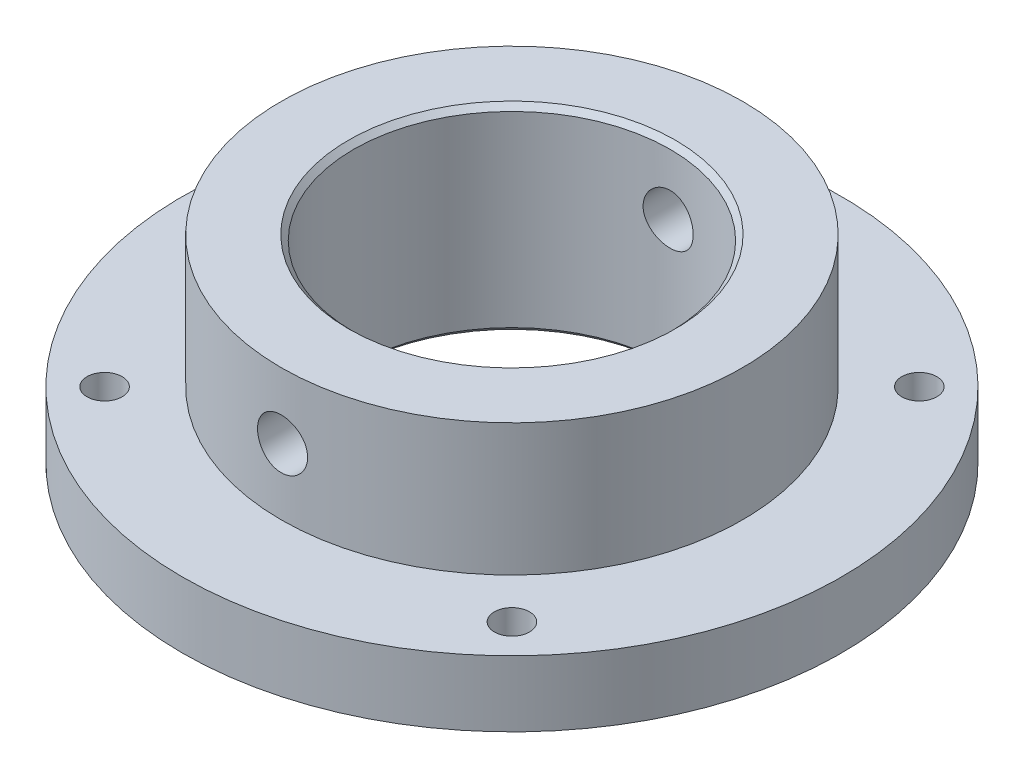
ISO-10303-21;
HEADER;
FILE_DESCRIPTION(('STEP AP214'),'2;1');
FILE_NAME('part.step','',(''),(''),'','','');
FILE_SCHEMA(('AUTOMOTIVE_DESIGN { 1 0 10303 214 1 1 1 1 }'));
ENDSEC;
DATA;
#1=APPLICATION_CONTEXT('core data for automotive mechanical design processes');
#2=APPLICATION_PROTOCOL_DEFINITION('international standard','automotive_design',2000,#1);
#3=PRODUCT_CONTEXT('',#1,'mechanical');
#4=PRODUCT('Part','Part','',(#3));
#5=PRODUCT_RELATED_PRODUCT_CATEGORY('part','',(#4));
#6=PRODUCT_DEFINITION_FORMATION('','',#4);
#7=PRODUCT_DEFINITION_CONTEXT('part definition',#1,'design');
#8=PRODUCT_DEFINITION('design','',#6,#7);
#9=PRODUCT_DEFINITION_SHAPE('','',#8);
#10=(LENGTH_UNIT() NAMED_UNIT(*) SI_UNIT(.MILLI.,.METRE.));
#11=(NAMED_UNIT(*) PLANE_ANGLE_UNIT() SI_UNIT($,.RADIAN.));
#12=(NAMED_UNIT(*) SI_UNIT($,.STERADIAN.) SOLID_ANGLE_UNIT());
#13=UNCERTAINTY_MEASURE_WITH_UNIT(LENGTH_MEASURE(1.E-05),#10,'distance_accuracy_value','');
#14=(GEOMETRIC_REPRESENTATION_CONTEXT(3) GLOBAL_UNCERTAINTY_ASSIGNED_CONTEXT((#13)) GLOBAL_UNIT_ASSIGNED_CONTEXT((#10,
#11,#12)) REPRESENTATION_CONTEXT('',''));
#15=CARTESIAN_POINT('',(0.,0.,0.));
#16=DIRECTION('',(0.,0.,1.));
#17=DIRECTION('',(1.,0.,0.));
#18=AXIS2_PLACEMENT_3D('',#15,#16,#17);
#19=CARTESIAN_POINT('',(0.,0.,0.));
#20=DIRECTION('',(0.,1.,0.));
#21=DIRECTION('',(0.,0.,1.));
#22=AXIS2_PLACEMENT_3D('',#19,#20,#21);
#23=CYLINDRICAL_SURFACE('',#22,30.48);
#24=CARTESIAN_POINT('',(0.,-17.526,30.48));
#25=CARTESIAN_POINT('',(0.134681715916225,-17.5260019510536,30.4800008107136));
#26=CARTESIAN_POINT('',(0.269336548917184,-17.5203602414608,30.47910564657));
#27=CARTESIAN_POINT('',(0.537724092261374,-17.4978390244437,30.4755517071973));
#28=CARTESIAN_POINT('',(0.6714565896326,-17.4809570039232,30.4728925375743));
#29=CARTESIAN_POINT('',(0.93708034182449,-17.4360652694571,30.465881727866));
#30=CARTESIAN_POINT('',(1.06897034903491,-17.4080483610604,30.4615289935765));
#31=CARTESIAN_POINT('',(1.32993620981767,-17.341088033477,30.451251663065));
#32=CARTESIAN_POINT('',(1.45901101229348,-17.3021406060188,30.445326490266));
#33=CARTESIAN_POINT('',(1.71323809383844,-17.213666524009,30.4320784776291));
#34=CARTESIAN_POINT('',(1.83839476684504,-17.1641522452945,30.4247572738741));
#35=CARTESIAN_POINT('',(2.08411945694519,-17.0548605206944,30.4089133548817));
#36=CARTESIAN_POINT('',(2.20468576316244,-16.9950792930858,30.4003901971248));
#37=CARTESIAN_POINT('',(2.44029240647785,-16.86572928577,30.3823851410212));
#38=CARTESIAN_POINT('',(2.55533551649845,-16.7961654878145,30.3729037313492));
#39=CARTESIAN_POINT('',(2.77922016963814,-16.6476905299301,30.3532365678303));
#40=CARTESIAN_POINT('',(2.88805938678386,-16.5687758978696,30.343050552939));
#41=CARTESIAN_POINT('',(3.09953222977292,-16.4015511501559,30.3221812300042));
#42=CARTESIAN_POINT('',(3.20211407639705,-16.3131759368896,30.3114948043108));
#43=CARTESIAN_POINT('',(3.39952203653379,-16.1280955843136,30.2899903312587));
#44=CARTESIAN_POINT('',(3.49434526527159,-16.0313873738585,30.2791722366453));
#45=CARTESIAN_POINT('',(3.67551241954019,-15.8303650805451,30.2577152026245));
#46=CARTESIAN_POINT('',(3.76185893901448,-15.7260533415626,30.2470762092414));
#47=CARTESIAN_POINT('',(3.92553420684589,-15.5104773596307,30.2262698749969));
#48=CARTESIAN_POINT('',(4.00285961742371,-15.3992105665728,30.2161027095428));
#49=CARTESIAN_POINT('',(4.14828743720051,-15.1699195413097,30.1964820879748));
#50=CARTESIAN_POINT('',(4.21634011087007,-15.0518633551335,30.1870325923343));
#51=CARTESIAN_POINT('',(4.34226627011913,-14.8103514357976,30.1691755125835));
#52=CARTESIAN_POINT('',(4.40013595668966,-14.6868937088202,30.1607683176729));
#53=CARTESIAN_POINT('',(4.55772166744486,-14.3098039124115,30.1375016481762));
#54=CARTESIAN_POINT('',(4.6415834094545,-14.0491882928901,30.1245733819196));
#55=CARTESIAN_POINT('',(4.76358543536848,-13.5196607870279,30.1055220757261));
#56=CARTESIAN_POINT('',(4.80210053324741,-13.2508360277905,30.0993432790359));
#57=CARTESIAN_POINT('',(4.83356641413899,-12.7104361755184,30.0943069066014));
#58=CARTESIAN_POINT('',(4.82652010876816,-12.4388612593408,30.0954488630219));
#59=CARTESIAN_POINT('',(4.76734455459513,-11.9033719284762,30.1048780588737));
#60=CARTESIAN_POINT('',(4.71563388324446,-11.6394098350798,30.1130989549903));
#61=CARTESIAN_POINT('',(4.56925987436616,-11.1239536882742,30.1356549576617));
#62=CARTESIAN_POINT('',(4.4745951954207,-10.8724600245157,30.1499902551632));
#63=CARTESIAN_POINT('',(4.24456872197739,-10.3878194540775,30.1832326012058));
#64=CARTESIAN_POINT('',(4.10903134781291,-10.1547572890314,30.202159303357));
#65=CARTESIAN_POINT('',(3.80123219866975,-9.71452534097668,30.2424378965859));
#66=CARTESIAN_POINT('',(3.6289677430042,-9.50735744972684,30.2637899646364));
#67=CARTESIAN_POINT('',(3.25031517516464,-9.12237081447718,30.3068057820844));
#68=CARTESIAN_POINT('',(3.04356758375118,-8.9449055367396,30.3284703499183));
#69=CARTESIAN_POINT('',(2.60303817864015,-8.62713512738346,30.3694492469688));
#70=CARTESIAN_POINT('',(2.36925622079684,-8.4868301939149,30.3887635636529));
#71=CARTESIAN_POINT('',(1.88097525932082,-8.24733825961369,30.4228893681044));
#72=CARTESIAN_POINT('',(1.62646169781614,-8.14818045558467,30.4376976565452));
#73=CARTESIAN_POINT('',(1.10410752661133,-7.99411487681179,30.4611167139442));
#74=CARTESIAN_POINT('',(0.836267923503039,-7.93920376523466,30.4697279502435));
#75=CARTESIAN_POINT('',(0.29791329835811,-7.87566476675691,30.4797202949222));
#76=CARTESIAN_POINT('',(0.0274569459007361,-7.86655128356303,30.4811772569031));
#77=CARTESIAN_POINT('',(-0.511120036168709,-7.89357454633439,30.4769039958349));
#78=CARTESIAN_POINT('',(-0.779240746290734,-7.92970972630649,30.4711740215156));
#79=CARTESIAN_POINT('',(-1.30405044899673,-8.04580069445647,30.4532176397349));
#80=CARTESIAN_POINT('',(-1.56079350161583,-8.12551803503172,30.4410265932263));
#81=CARTESIAN_POINT('',(-2.05727047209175,-8.32625772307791,30.4115100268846));
#82=CARTESIAN_POINT('',(-2.2970035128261,-8.44728219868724,30.3941842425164));
#83=CARTESIAN_POINT('',(-2.75477797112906,-8.72832648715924,30.356133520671));
#84=CARTESIAN_POINT('',(-2.97262946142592,-8.88865204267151,30.3353823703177));
#85=CARTESIAN_POINT('',(-3.37850820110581,-9.24332522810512,30.2928672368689));
#86=CARTESIAN_POINT('',(-3.56653350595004,-9.43767507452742,30.2711031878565));
#87=CARTESIAN_POINT('',(-3.9092059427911,-9.85704606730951,30.2287722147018));
#88=CARTESIAN_POINT('',(-4.06352628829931,-10.0823357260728,30.2082183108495));
#89=CARTESIAN_POINT('',(-4.33213024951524,-10.5559360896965,30.1708720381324));
#90=CARTESIAN_POINT('',(-4.44641504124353,-10.8042461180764,30.1540795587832));
#91=CARTESIAN_POINT('',(-4.63121051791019,-11.3158424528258,30.126251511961));
#92=CARTESIAN_POINT('',(-4.70188861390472,-11.5790671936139,30.1151939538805));
#93=CARTESIAN_POINT('',(-4.79797727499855,-12.1139904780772,30.1000379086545));
#94=CARTESIAN_POINT('',(-4.82339135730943,-12.3856883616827,30.095938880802));
#95=CARTESIAN_POINT('',(-4.82700876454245,-12.7917367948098,30.0953529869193));
#96=CARTESIAN_POINT('',(-4.82257401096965,-12.9261470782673,30.096067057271));
#97=CARTESIAN_POINT('',(-4.80251586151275,-13.1940952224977,30.0992753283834));
#98=CARTESIAN_POINT('',(-4.78689666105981,-13.3276333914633,30.1017688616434));
#99=CARTESIAN_POINT('',(-4.7445759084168,-13.5929371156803,30.1084680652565));
#100=CARTESIAN_POINT('',(-4.71787038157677,-13.7247020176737,30.1126743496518));
#101=CARTESIAN_POINT('',(-4.65359319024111,-13.9854439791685,30.1226746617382));
#102=CARTESIAN_POINT('',(-4.61602544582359,-14.1144220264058,30.1284681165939));
#103=CARTESIAN_POINT('',(-4.53032479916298,-14.368657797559,30.1414736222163));
#104=CARTESIAN_POINT('',(-4.48219820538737,-14.4939176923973,30.1486848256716));
#105=CARTESIAN_POINT('',(-4.37573780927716,-14.739888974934,30.1643201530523));
#106=CARTESIAN_POINT('',(-4.31740767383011,-14.8606019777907,30.1727438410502));
#107=CARTESIAN_POINT('',(-4.19092102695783,-15.0967488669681,30.1905723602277));
#108=CARTESIAN_POINT('',(-4.12276071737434,-15.2121806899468,30.1999775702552));
#109=CARTESIAN_POINT('',(-3.97713519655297,-15.4368944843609,30.2195001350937));
#110=CARTESIAN_POINT('',(-3.89967327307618,-15.5461786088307,30.2296172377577));
#111=CARTESIAN_POINT('',(-3.73505038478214,-15.7590818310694,30.2504009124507));
#112=CARTESIAN_POINT('',(-3.6477913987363,-15.8626246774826,30.2610723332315));
#113=CARTESIAN_POINT('',(-3.46492630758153,-16.0619711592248,30.2825552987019));
#114=CARTESIAN_POINT('',(-3.36932320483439,-16.1577775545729,30.2933667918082));
#115=CARTESIAN_POINT('',(-3.17034102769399,-16.3410882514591,30.3148372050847));
#116=CARTESIAN_POINT('',(-3.06695733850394,-16.4285875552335,30.3254960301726));
#117=CARTESIAN_POINT('',(-2.85321394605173,-16.5945795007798,30.3463522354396));
#118=CARTESIAN_POINT('',(-2.74285683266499,-16.6730754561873,30.3565497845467));
#119=CARTESIAN_POINT('',(-2.5151438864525,-16.8210293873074,30.37626695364));
#120=CARTESIAN_POINT('',(-2.39774685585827,-16.8904246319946,30.3857816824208));
#121=CARTESIAN_POINT('',(-2.15748561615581,-17.0190384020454,30.4037853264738));
#122=CARTESIAN_POINT('',(-2.03462343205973,-17.0782606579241,30.4122746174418));
#123=CARTESIAN_POINT('',(-1.78434479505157,-17.1860828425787,30.4279841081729));
#124=CARTESIAN_POINT('',(-1.65693167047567,-17.2346903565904,30.4352052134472));
#125=CARTESIAN_POINT('',(-1.39842403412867,-17.3209584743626,30.4481784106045));
#126=CARTESIAN_POINT('',(-1.26733033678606,-17.3586214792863,30.4539308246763));
#127=CARTESIAN_POINT('',(-0.949362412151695,-17.4355432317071,30.4657757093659));
#128=CARTESIAN_POINT('',(-0.761131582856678,-17.4694254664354,30.471085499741));
#129=CARTESIAN_POINT('',(-0.38191579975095,-17.5146523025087,30.4781970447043));
#130=CARTESIAN_POINT('',(-0.190930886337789,-17.5259972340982,30.4799988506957));
#131=CARTESIAN_POINT('',(0.,-17.526,30.48));
#132=B_SPLINE_CURVE_WITH_KNOTS('',3,(#24,#25,#26,#27,#28,#29,#30,#31,#32,#33,#34,#35,#36,#37,
#38,#39,#40,#41,#42,#43,#44,#45,#46,#47,#48,#49,#50,#51,#52,#53,#54,#55,#56,#57,#58,#59,#60,#61,
#62,#63,#64,#65,#66,#67,#68,#69,#70,#71,#72,#73,#74,#75,#76,#77,#78,#79,#80,#81,#82,#83,#84,#85,
#86,#87,#88,#89,#90,#91,#92,#93,#94,#95,#96,#97,#98,#99,#100,#101,#102,#103,#104,#105,#106,#107,
#108,#109,#110,#111,#112,#113,#114,#115,#116,#117,#118,#119,#120,#121,#122,#123,#124,#125,#126,
#127,#128,#129,#130,#131),.UNSPECIFIED.,.T.,.F.,(4,2,2,2,2,2,2,2,2,2,2,2,2,2,2,2,2,2,2,2,2,2,2,
2,2,2,2,2,2,2,2,2,2,2,2,2,2,2,2,2,2,2,2,2,2,2,2,2,2,2,2,2,2,4),(0.,0.403877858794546,
0.807846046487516,1.21207567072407,1.61645372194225,2.02036074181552,2.42441685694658,
2.8282679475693,3.23226946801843,3.63925531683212,4.04639180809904,4.45340332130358,
4.8605649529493,5.2698310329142,5.67924947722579,6.49714793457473,7.3082374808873,
8.1192751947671,8.92279363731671,9.72633717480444,10.533382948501,11.3404876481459,
12.1566026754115,12.9727220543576,13.789419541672,14.6060554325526,15.4140139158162,
16.2219444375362,17.0254981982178,17.8290933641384,18.6391503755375,19.4492601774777,
20.2669063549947,21.0845285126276,21.8989918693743,22.7133919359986,23.1164551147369,
23.5193671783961,23.9224238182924,24.3253351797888,24.7280064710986,25.1305333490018,
25.5332161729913,25.9357570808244,26.3427614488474,26.7496199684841,27.1567217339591,
27.5636731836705,27.9732968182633,28.3827699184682,28.7919494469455,29.2010391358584,
29.7736030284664,30.3461585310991),.UNSPECIFIED.);
#133=CARTESIAN_POINT('',(0.,-17.526,30.48));
#134=VERTEX_POINT('',#133);
#135=EDGE_CURVE('E83',#134,#134,#132,.T.);
#136=ORIENTED_EDGE('',*,*,#135,.T.);
#137=EDGE_LOOP('',(#136));
#138=FACE_BOUND('',#137,.T.);
#139=CARTESIAN_POINT('',(4.826,-12.7,-30.0955166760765));
#140=CARTESIAN_POINT('',(4.82600195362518,-12.8346698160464,-30.0955158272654));
#141=CARTESIAN_POINT('',(4.82036123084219,-12.9693127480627,-30.0964223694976));
#142=CARTESIAN_POINT('',(4.79784405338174,-13.2376761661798,-30.1000204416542));
#143=CARTESIAN_POINT('',(4.78096508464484,-13.3713964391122,-30.1027123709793));
#144=CARTESIAN_POINT('',(4.73608169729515,-13.6369954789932,-30.1098064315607));
#145=CARTESIAN_POINT('',(4.70807006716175,-13.7688729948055,-30.1142096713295));
#146=CARTESIAN_POINT('',(4.64112276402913,-14.0298136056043,-30.1246000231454));
#147=CARTESIAN_POINT('',(4.60218308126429,-14.1588756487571,-30.1305877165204));
#148=CARTESIAN_POINT('',(4.51372770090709,-14.4130755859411,-30.1439655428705));
#149=CARTESIAN_POINT('',(4.46422453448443,-14.5382179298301,-30.1513540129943));
#150=CARTESIAN_POINT('',(4.35495773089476,-14.7839151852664,-30.1673298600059));
#151=CARTESIAN_POINT('',(4.29519031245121,-14.9044683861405,-30.1759176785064));
#152=CARTESIAN_POINT('',(4.16587004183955,-15.1400511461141,-30.1940422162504));
#153=CARTESIAN_POINT('',(4.09632215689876,-15.2550834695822,-30.2035784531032));
#154=CARTESIAN_POINT('',(3.94788049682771,-15.4789494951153,-30.2233394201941));
#155=CARTESIAN_POINT('',(3.86898324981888,-15.5877808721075,-30.2335644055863));
#156=CARTESIAN_POINT('',(3.70177593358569,-15.7992643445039,-30.2544939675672));
#157=CARTESIAN_POINT('',(3.61339885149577,-15.9018631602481,-30.2652015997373));
#158=CARTESIAN_POINT('',(3.42831116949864,-16.0993052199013,-30.2867258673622));
#159=CARTESIAN_POINT('',(3.33159749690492,-16.1941455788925,-30.2975425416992));
#160=CARTESIAN_POINT('',(3.13056087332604,-16.3753462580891,-30.3189742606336));
#161=CARTESIAN_POINT('',(3.02624028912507,-16.4617091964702,-30.3295893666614));
#162=CARTESIAN_POINT('',(2.81064324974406,-16.6254160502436,-30.3503281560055));
#163=CARTESIAN_POINT('',(2.69936424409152,-16.7027566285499,-30.3604516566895));
#164=CARTESIAN_POINT('',(2.47006343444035,-16.8482017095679,-30.3799683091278));
#165=CARTESIAN_POINT('',(2.35201060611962,-16.9162579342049,-30.3893575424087));
#166=CARTESIAN_POINT('',(2.11050509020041,-17.0421915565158,-30.4070860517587));
#167=CARTESIAN_POINT('',(1.98705040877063,-17.1000651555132,-30.4154249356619));
#168=CARTESIAN_POINT('',(1.60996982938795,-17.2576629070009,-30.4384864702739));
#169=CARTESIAN_POINT('',(1.34936091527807,-17.3415328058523,-30.4512775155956));
#170=CARTESIAN_POINT('',(0.819856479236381,-17.4635510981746,-30.4701152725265));
#171=CARTESIAN_POINT('',(0.551048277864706,-17.5020752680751,-30.4762173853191));
#172=CARTESIAN_POINT('',(0.0106810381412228,-17.5335650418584,-30.4811944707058));
#173=CARTESIAN_POINT('',(-0.260877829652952,-17.5265334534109,-30.480069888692));
#174=CARTESIAN_POINT('',(-0.796430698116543,-17.4673817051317,-30.4707603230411));
#175=CARTESIAN_POINT('',(-1.06047062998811,-17.4156652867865,-30.462638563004));
#176=CARTESIAN_POINT('',(-1.57607946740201,-17.269252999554,-30.4403187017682));
#177=CARTESIAN_POINT('',(-1.82764802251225,-17.1745559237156,-30.426120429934));
#178=CARTESIAN_POINT('',(-2.31238132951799,-16.944461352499,-30.3931344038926));
#179=CARTESIAN_POINT('',(-2.54546490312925,-16.8088956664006,-30.3743277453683));
#180=CARTESIAN_POINT('',(-2.98572776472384,-16.5010355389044,-30.3342178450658));
#181=CARTESIAN_POINT('',(-3.1929051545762,-16.328738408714,-30.3129144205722));
#182=CARTESIAN_POINT('',(-3.57785678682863,-15.9500620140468,-30.2699081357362));
#183=CARTESIAN_POINT('',(-3.75528410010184,-15.7433300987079,-30.2482034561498));
#184=CARTESIAN_POINT('',(-4.07298528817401,-15.3028458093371,-30.207067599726));
#185=CARTESIAN_POINT('',(-4.21325888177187,-15.0690932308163,-30.1876364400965));
#186=CARTESIAN_POINT('',(-4.45272798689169,-14.5808215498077,-30.153247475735));
#187=CARTESIAN_POINT('',(-4.55188486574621,-14.3262831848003,-30.1382938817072));
#188=CARTESIAN_POINT('',(-4.70594105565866,-13.8038749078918,-30.1146252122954));
#189=CARTESIAN_POINT('',(-4.76084386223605,-13.5360060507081,-30.1059096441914));
#190=CARTESIAN_POINT('',(-4.82435143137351,-12.9976357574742,-30.0957982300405));
#191=CARTESIAN_POINT('',(-4.83344932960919,-12.7271939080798,-30.0943244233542));
#192=CARTESIAN_POINT('',(-4.80640007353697,-12.1886496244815,-30.0986560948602));
#193=CARTESIAN_POINT('',(-4.77025448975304,-11.9205471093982,-30.1044613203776));
#194=CARTESIAN_POINT('',(-4.65416365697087,-11.3958385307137,-30.1226251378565));
#195=CARTESIAN_POINT('',(-4.57446668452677,-11.1391761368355,-30.1349465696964));
#196=CARTESIAN_POINT('',(-4.37379460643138,-10.6428515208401,-30.1647235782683));
#197=CARTESIAN_POINT('',(-4.25281725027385,-10.4031902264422,-30.1821794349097));
#198=CARTESIAN_POINT('',(-3.9718441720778,-9.9454680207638,-30.2204409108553));
#199=CARTESIAN_POINT('',(-3.81153079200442,-9.7276043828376,-30.2412733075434));
#200=CARTESIAN_POINT('',(-3.45687426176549,-9.32169550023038,-30.2838610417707));
#201=CARTESIAN_POINT('',(-3.26252895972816,-9.13365214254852,-30.3056164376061));
#202=CARTESIAN_POINT('',(-2.84315083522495,-8.79093586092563,-30.347844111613));
#203=CARTESIAN_POINT('',(-2.61784854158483,-8.63659075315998,-30.3683025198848));
#204=CARTESIAN_POINT('',(-2.14421584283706,-8.36794339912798,-30.4054117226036));
#205=CARTESIAN_POINT('',(-1.89588612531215,-8.25363995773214,-30.4220626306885));
#206=CARTESIAN_POINT('',(-1.38429831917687,-8.06883312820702,-30.4496220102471));
#207=CARTESIAN_POINT('',(-1.12110474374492,-7.99815427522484,-30.4605534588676));
#208=CARTESIAN_POINT('',(-0.586247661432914,-7.90205352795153,-30.475532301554));
#209=CARTESIAN_POINT('',(-0.314584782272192,-7.87662828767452,-30.4795802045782));
#210=CARTESIAN_POINT('',(0.0914547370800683,-7.87298521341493,-30.4801624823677));
#211=CARTESIAN_POINT('',(0.225889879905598,-7.87741324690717,-30.4794586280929));
#212=CARTESIAN_POINT('',(0.493888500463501,-7.89746217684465,-30.4762918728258));
#213=CARTESIAN_POINT('',(0.627452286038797,-7.91307887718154,-30.4738296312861));
#214=CARTESIAN_POINT('',(0.892807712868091,-7.95539902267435,-30.4672108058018));
#215=CARTESIAN_POINT('',(1.02459870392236,-7.9821064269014,-30.4630536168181));
#216=CARTESIAN_POINT('',(1.28539303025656,-8.04639197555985,-30.4531637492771));
#217=CARTESIAN_POINT('',(1.41439735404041,-8.0839661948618,-30.4474316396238));
#218=CARTESIAN_POINT('',(1.66868977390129,-8.16968602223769,-30.4345539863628));
#219=CARTESIAN_POINT('',(1.79397990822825,-8.21782570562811,-30.427409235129));
#220=CARTESIAN_POINT('',(2.0400096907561,-8.32431745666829,-30.4119047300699));
#221=CARTESIAN_POINT('',(2.16075095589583,-8.38266585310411,-30.4035454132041));
#222=CARTESIAN_POINT('',(2.39695105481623,-8.50919355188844,-30.385836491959));
#223=CARTESIAN_POINT('',(2.51240783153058,-8.57737664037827,-30.3764865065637));
#224=CARTESIAN_POINT('',(2.73716725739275,-8.72305143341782,-30.3570590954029));
#225=CARTESIAN_POINT('',(2.84647206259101,-8.80053984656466,-30.3469819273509));
#226=CARTESIAN_POINT('',(3.05937672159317,-8.96519160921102,-30.3262621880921));
#227=CARTESIAN_POINT('',(3.16290255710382,-9.05245006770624,-30.3156147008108));
#228=CARTESIAN_POINT('',(3.36221471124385,-9.23531057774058,-30.2941571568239));
#229=CARTESIAN_POINT('',(3.45800378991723,-9.33090962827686,-30.2833471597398));
#230=CARTESIAN_POINT('',(3.64128032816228,-9.5298802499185,-30.2618571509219));
#231=CARTESIAN_POINT('',(3.7287627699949,-9.63325645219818,-30.2511772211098));
#232=CARTESIAN_POINT('',(3.89472205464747,-9.84698146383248,-30.230258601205));
#233=CARTESIAN_POINT('',(3.97320220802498,-9.95732768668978,-30.220019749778));
#234=CARTESIAN_POINT('',(4.12113664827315,-10.1850318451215,-30.2002026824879));
#235=CARTESIAN_POINT('',(4.19052687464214,-10.3024318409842,-30.1906293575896));
#236=CARTESIAN_POINT('',(4.31913034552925,-10.5426984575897,-30.1724995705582));
#237=CARTESIAN_POINT('',(4.37834732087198,-10.665563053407,-30.1639427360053));
#238=CARTESIAN_POINT('',(4.48615885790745,-10.9158463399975,-30.1480969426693));
#239=CARTESIAN_POINT('',(4.53476102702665,-11.0432616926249,-30.1408070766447));
#240=CARTESIAN_POINT('',(4.62101851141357,-11.3017743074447,-30.1277029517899));
#241=CARTESIAN_POINT('',(4.65867623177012,-11.4328707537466,-30.1218883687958));
#242=CARTESIAN_POINT('',(4.73557592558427,-11.7508080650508,-30.1099123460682));
#243=CARTESIAN_POINT('',(4.76944583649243,-11.9390047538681,-30.1045395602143));
#244=CARTESIAN_POINT('',(4.81465631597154,-12.3181523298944,-30.0973423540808));
#245=CARTESIAN_POINT('',(4.82599723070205,-12.5091031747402,-30.0955178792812));
#246=CARTESIAN_POINT('',(4.826,-12.7,-30.0955166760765));
#247=B_SPLINE_CURVE_WITH_KNOTS('',3,(#139,#140,#141,#142,#143,#144,#145,#146,#147,#148,#149,
#150,#151,#152,#153,#154,#155,#156,#157,#158,#159,#160,#161,#162,#163,#164,#165,#166,#167,#168,
#169,#170,#171,#172,#173,#174,#175,#176,#177,#178,#179,#180,#181,#182,#183,#184,#185,#186,#187,
#188,#189,#190,#191,#192,#193,#194,#195,#196,#197,#198,#199,#200,#201,#202,#203,#204,#205,#206,
#207,#208,#209,#210,#211,#212,#213,#214,#215,#216,#217,#218,#219,#220,#221,#222,#223,#224,#225,
#226,#227,#228,#229,#230,#231,#232,#233,#234,#235,#236,#237,#238,#239,#240,#241,#242,#243,#244,
#245,#246),.UNSPECIFIED.,.T.,.F.,(4,2,2,2,2,2,2,2,2,2,2,2,2,2,2,2,2,2,2,2,2,2,2,2,2,2,2,2,2,2,2,
2,2,2,2,2,2,2,2,2,2,2,2,2,2,2,2,2,2,2,2,2,2,4),(0.,0.403842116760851,0.807774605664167,
1.21196918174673,1.61631226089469,2.02017831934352,2.42419347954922,2.82800418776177,
3.23196532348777,3.6389981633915,4.04618167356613,4.45323903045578,4.86044647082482,
5.26969662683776,5.67909913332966,6.49696732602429,7.30800909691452,8.11900088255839,
8.92274082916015,9.72650334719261,10.533619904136,11.3407955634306,12.1568127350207,
12.97283608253,13.7896244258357,14.6063482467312,15.4142601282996,16.2221439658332,
17.0254695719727,17.8288389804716,18.6389228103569,19.4490578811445,20.2667537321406,
21.0844251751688,21.8987860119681,22.7130866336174,23.1162235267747,23.519209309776,
23.9223390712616,24.3253234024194,24.7280823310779,25.1306967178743,25.5334665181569,
25.9360942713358,26.3430531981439,26.7498662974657,27.1569235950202,27.5638307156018,
27.9734667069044,28.3829521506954,28.7921431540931,29.2012441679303,29.773706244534,
30.3461595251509),.UNSPECIFIED.);
#248=CARTESIAN_POINT('',(4.826,-12.7,-30.0955166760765));
#249=VERTEX_POINT('',#248);
#250=EDGE_CURVE('E78',#249,#249,#247,.T.);
#251=ORIENTED_EDGE('',*,*,#250,.T.);
#252=EDGE_LOOP('',(#251));
#253=FACE_BOUND('',#252,.T.);
#254=CARTESIAN_POINT('',(0.,-1.01599999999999,0.));
#255=DIRECTION('',(0.,-1.,0.));
#256=DIRECTION('',(0.,0.,-1.));
#257=AXIS2_PLACEMENT_3D('',#254,#255,#256);
#258=CIRCLE('',#257,30.48);
#259=CARTESIAN_POINT('',(0.,-1.01599999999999,-30.48));
#260=VERTEX_POINT('',#259);
#261=EDGE_CURVE('E51',#260,#260,#258,.F.);
#262=ORIENTED_EDGE('',*,*,#261,.T.);
#263=EDGE_LOOP('',(#262));
#264=FACE_BOUND('',#263,.T.);
#265=CARTESIAN_POINT('',(0.,-37.084,0.));
#266=DIRECTION('',(0.,1.,0.));
#267=DIRECTION('',(0.,0.,1.));
#268=AXIS2_PLACEMENT_3D('',#265,#266,#267);
#269=CIRCLE('',#268,30.48);
#270=CARTESIAN_POINT('',(0.,-37.084,30.48));
#271=VERTEX_POINT('',#270);
#272=EDGE_CURVE('E101',#271,#271,#269,.F.);
#273=ORIENTED_EDGE('',*,*,#272,.T.);
#274=EDGE_LOOP('',(#273));
#275=FACE_BOUND('',#274,.T.);
#276=ADVANCED_FACE('F34',(#138,#253,#264,#275),#23,.F.);
#277=CARTESIAN_POINT('',(30.48,0.,0.));
#278=DIRECTION('',(0.,-1.,0.));
#279=DIRECTION('',(0.,0.,-1.));
#280=AXIS2_PLACEMENT_3D('',#277,#278,#279);
#281=PLANE('',#280);
#282=CARTESIAN_POINT('',(0.,0.,0.));
#283=DIRECTION('',(0.,-1.,0.));
#284=DIRECTION('',(0.,0.,-1.));
#285=AXIS2_PLACEMENT_3D('',#282,#283,#284);
#286=CIRCLE('',#285,31.496);
#287=CARTESIAN_POINT('',(0.,0.,-31.496));
#288=VERTEX_POINT('',#287);
#289=EDGE_CURVE('E46',#288,#288,#286,.T.);
#290=ORIENTED_EDGE('',*,*,#289,.T.);
#291=EDGE_LOOP('',(#290));
#292=FACE_BOUND('',#291,.T.);
#293=CARTESIAN_POINT('',(0.,0.,0.));
#294=DIRECTION('',(0.,1.,0.));
#295=DIRECTION('',(0.,0.,1.));
#296=AXIS2_PLACEMENT_3D('',#293,#294,#295);
#297=CIRCLE('',#296,44.45);
#298=CARTESIAN_POINT('',(0.,0.,44.45));
#299=VERTEX_POINT('',#298);
#300=EDGE_CURVE('E98',#299,#299,#297,.T.);
#301=ORIENTED_EDGE('',*,*,#300,.T.);
#302=EDGE_LOOP('',(#301));
#303=FACE_BOUND('',#302,.T.);
#304=ADVANCED_FACE('F122',(#292,#303),#281,.F.);
#305=CARTESIAN_POINT('',(0.,0.,0.));
#306=DIRECTION('',(0.,1.,0.));
#307=DIRECTION('',(0.,0.,1.));
#308=AXIS2_PLACEMENT_3D('',#305,#306,#307);
#309=CYLINDRICAL_SURFACE('',#308,44.45);
#310=CARTESIAN_POINT('',(0.,-17.526,44.45));
#311=CARTESIAN_POINT('',(-0.135160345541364,-17.5260013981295,44.4500004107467));
#312=CARTESIAN_POINT('',(-0.270299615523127,-17.5203198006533,44.4493822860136));
#313=CARTESIAN_POINT('',(-0.539656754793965,-17.497636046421,44.4469279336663));
#314=CARTESIAN_POINT('',(-0.673874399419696,-17.480631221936,44.4450914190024));
#315=CARTESIAN_POINT('',(-0.940489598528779,-17.4354043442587,44.4402494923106));
#316=CARTESIAN_POINT('',(-1.07288564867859,-17.4071735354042,44.4372431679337));
#317=CARTESIAN_POINT('',(-1.334860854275,-17.3396901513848,44.4301454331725));
#318=CARTESIAN_POINT('',(-1.46443895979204,-17.3004335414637,44.4260536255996));
#319=CARTESIAN_POINT('',(-1.71968176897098,-17.2112336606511,44.4169054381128));
#320=CARTESIAN_POINT('',(-1.84535025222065,-17.1613011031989,44.4118500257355));
#321=CARTESIAN_POINT('',(-2.09207154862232,-17.0510659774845,44.4009120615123));
#322=CARTESIAN_POINT('',(-2.21312264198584,-16.9907595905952,44.3950292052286));
#323=CARTESIAN_POINT('',(-2.44964604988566,-16.8602576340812,44.3826064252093));
#324=CARTESIAN_POINT('',(-2.5651214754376,-16.7900676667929,44.376066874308));
#325=CARTESIAN_POINT('',(-2.78980448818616,-16.6402419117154,44.3625085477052));
#326=CARTESIAN_POINT('',(-2.89900973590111,-16.5606026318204,44.3554895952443));
#327=CARTESIAN_POINT('',(-3.11070471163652,-16.392174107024,44.3411469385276));
#328=CARTESIAN_POINT('',(-3.21317050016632,-16.303354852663,44.3338222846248));
#329=CARTESIAN_POINT('',(-3.41030115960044,-16.1173806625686,44.3190943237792));
#330=CARTESIAN_POINT('',(-3.50496313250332,-16.0202226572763,44.3116909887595));
#331=CARTESIAN_POINT('',(-3.68575122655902,-15.8183121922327,44.297019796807));
#332=CARTESIAN_POINT('',(-3.77188007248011,-15.7135621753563,44.289751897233));
#333=CARTESIAN_POINT('',(-3.93506005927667,-15.49713294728,44.2755521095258));
#334=CARTESIAN_POINT('',(-4.01210783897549,-15.3854511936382,44.268620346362));
#335=CARTESIAN_POINT('',(-4.15669785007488,-15.1557274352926,44.2552781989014));
#336=CARTESIAN_POINT('',(-4.22421926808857,-15.0376722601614,44.248868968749));
#337=CARTESIAN_POINT('',(-4.34909715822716,-14.796214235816,44.2367696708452));
#338=CARTESIAN_POINT('',(-4.4064498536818,-14.6728094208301,44.2310798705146));
#339=CARTESIAN_POINT('',(-4.51052317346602,-14.4216047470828,44.2205882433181));
#340=CARTESIAN_POINT('',(-4.55724796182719,-14.2938066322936,44.2157860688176));
#341=CARTESIAN_POINT('',(-4.63976579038,-14.0346813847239,44.2072026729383));
#342=CARTESIAN_POINT('',(-4.67555480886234,-13.9033529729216,44.2034218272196));
#343=CARTESIAN_POINT('',(-4.76579632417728,-13.5066186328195,44.1938179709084));
#344=CARTESIAN_POINT('',(-4.80365263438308,-13.2371818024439,44.1896784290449));
#345=CARTESIAN_POINT('',(-4.83361521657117,-12.6958963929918,44.1864103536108));
#346=CARTESIAN_POINT('',(-4.82572289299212,-12.4240478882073,44.1872816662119));
#347=CARTESIAN_POINT('',(-4.76461835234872,-11.8867044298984,44.1939117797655));
#348=CARTESIAN_POINT('',(-4.71160044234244,-11.6211872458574,44.1996496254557));
#349=CARTESIAN_POINT('',(-4.56203631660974,-11.1028521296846,44.2153358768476));
#350=CARTESIAN_POINT('',(-4.46548941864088,-10.8500343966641,44.2252843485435));
#351=CARTESIAN_POINT('',(-4.23139946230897,-10.3636512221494,44.2482943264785));
#352=CARTESIAN_POINT('',(-4.09377073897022,-10.1301273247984,44.2613623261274));
#353=CARTESIAN_POINT('',(-3.78148422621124,-9.68941899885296,44.289133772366));
#354=CARTESIAN_POINT('',(-3.60682515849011,-9.48223547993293,44.3038372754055));
#355=CARTESIAN_POINT('',(-3.22435330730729,-9.0989591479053,44.3333163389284));
#356=CARTESIAN_POINT('',(-3.0163727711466,-8.92303368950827,44.3480918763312));
#357=CARTESIAN_POINT('',(-2.57374263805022,-8.60856661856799,44.3759781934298));
#358=CARTESIAN_POINT('',(-2.33909300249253,-8.4700250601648,44.3890889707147));
#359=CARTESIAN_POINT('',(-1.84966541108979,-8.23426295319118,44.4121739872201));
#360=CARTESIAN_POINT('',(-1.59488302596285,-8.13705152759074,44.4221475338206));
#361=CARTESIAN_POINT('',(-1.07247973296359,-7.98683506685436,44.4378275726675));
#362=CARTESIAN_POINT('',(-0.804859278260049,-7.9338284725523,44.4435342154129));
#363=CARTESIAN_POINT('',(-0.265825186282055,-7.87374010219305,44.4500180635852));
#364=CARTESIAN_POINT('',(0.00556243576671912,-7.86642751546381,44.4508200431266));
#365=CARTESIAN_POINT('',(0.545698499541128,-7.89732760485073,44.4474707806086));
#366=CARTESIAN_POINT('',(0.814446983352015,-7.93553955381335,44.4433196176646));
#367=CARTESIAN_POINT('',(1.34100507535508,-8.05621242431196,44.4305462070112));
#368=CARTESIAN_POINT('',(1.59883988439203,-8.13856464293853,44.4219349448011));
#369=CARTESIAN_POINT('',(2.09703658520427,-8.34506832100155,44.40120673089));
#370=CARTESIAN_POINT('',(2.33739801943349,-8.46922087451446,44.3890896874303));
#371=CARTESIAN_POINT('',(2.79486455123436,-8.75636868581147,44.3626420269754));
#372=CARTESIAN_POINT('',(3.01187442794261,-8.91951484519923,44.3483028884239));
#373=CARTESIAN_POINT('',(3.41551219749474,-9.27980427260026,44.3190456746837));
#374=CARTESIAN_POINT('',(3.60213918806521,-9.47694854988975,44.3041275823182));
#375=CARTESIAN_POINT('',(3.94052089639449,-9.90064460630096,44.2753185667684));
#376=CARTESIAN_POINT('',(4.09212364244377,-10.1273181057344,44.2614322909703));
#377=CARTESIAN_POINT('',(4.35510569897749,-10.6030544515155,44.236332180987));
#378=CARTESIAN_POINT('',(4.46648564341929,-10.8521169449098,44.2251183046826));
#379=CARTESIAN_POINT('',(4.64561372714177,-11.3649992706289,44.2066613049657));
#380=CARTESIAN_POINT('',(4.71345076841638,-11.6287878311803,44.1994100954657));
#381=CARTESIAN_POINT('',(4.8038363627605,-12.1642430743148,44.1896799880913));
#382=CARTESIAN_POINT('',(4.82638646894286,-12.4359094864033,44.1872009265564));
#383=CARTESIAN_POINT('',(4.82579938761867,-12.8423722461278,44.1872611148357));
#384=CARTESIAN_POINT('',(4.81991609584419,-12.9774069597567,44.1879057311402));
#385=CARTESIAN_POINT('',(4.79685614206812,-13.2464836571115,44.190415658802));
#386=CARTESIAN_POINT('',(4.77968367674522,-13.3805259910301,44.192280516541));
#387=CARTESIAN_POINT('',(4.73415803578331,-13.6467170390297,44.1971804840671));
#388=CARTESIAN_POINT('',(4.70580077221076,-13.7788650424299,44.2002160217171));
#389=CARTESIAN_POINT('',(4.63812816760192,-14.0402455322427,44.2073684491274));
#390=CARTESIAN_POINT('',(4.59881682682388,-14.1694790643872,44.2114849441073));
#391=CARTESIAN_POINT('',(4.50950917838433,-14.4241867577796,44.2206833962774));
#392=CARTESIAN_POINT('',(4.45951115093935,-14.5496603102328,44.2257655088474));
#393=CARTESIAN_POINT('',(4.34921397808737,-14.7959024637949,44.2367483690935));
#394=CARTESIAN_POINT('',(4.28891858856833,-14.9166727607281,44.2426488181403));
#395=CARTESIAN_POINT('',(4.15841999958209,-15.1527570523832,44.2551052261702));
#396=CARTESIAN_POINT('',(4.08821325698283,-15.2680690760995,44.2616614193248));
#397=CARTESIAN_POINT('',(3.93843135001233,-15.492348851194,44.2752403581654));
#398=CARTESIAN_POINT('',(3.85885957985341,-15.6013188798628,44.2822629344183));
#399=CARTESIAN_POINT('',(3.69043104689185,-15.8127741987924,44.2966183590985));
#400=CARTESIAN_POINT('',(3.60152656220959,-15.9152213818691,44.3039526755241));
#401=CARTESIAN_POINT('',(3.41544939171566,-16.1122330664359,44.3186857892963));
#402=CARTESIAN_POINT('',(3.31827972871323,-16.2068004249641,44.3260845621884));
#403=CARTESIAN_POINT('',(3.1162629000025,-16.3874865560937,44.340744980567));
#404=CARTESIAN_POINT('',(3.01141111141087,-16.4736001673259,44.3480065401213));
#405=CARTESIAN_POINT('',(2.79485629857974,-16.636676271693,44.3621803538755));
#406=CARTESIAN_POINT('',(2.68315581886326,-16.7136421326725,44.3690927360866));
#407=CARTESIAN_POINT('',(2.45327184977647,-16.8581517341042,44.3823980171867));
#408=CARTESIAN_POINT('',(2.33506821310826,-16.9256635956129,44.3887891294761));
#409=CARTESIAN_POINT('',(2.09339740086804,-17.0504541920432,44.4008425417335));
#410=CARTESIAN_POINT('',(1.96993217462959,-17.1077366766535,44.406505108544));
#411=CARTESIAN_POINT('',(1.71867206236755,-17.2116412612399,44.4169388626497));
#412=CARTESIAN_POINT('',(1.59088076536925,-17.2582719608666,44.421710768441));
#413=CARTESIAN_POINT('',(1.33183000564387,-17.340579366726,44.4302321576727));
#414=CARTESIAN_POINT('',(1.20057139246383,-17.3762587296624,44.4339818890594));
#415=CARTESIAN_POINT('',(0.893025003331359,-17.4460468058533,44.441372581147));
#416=CARTESIAN_POINT('',(0.715768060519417,-17.4759997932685,44.4445948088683));
#417=CARTESIAN_POINT('',(0.358995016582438,-17.5159754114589,44.4489082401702));
#418=CARTESIAN_POINT('',(0.179478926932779,-17.5259981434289,44.4499994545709));
#419=CARTESIAN_POINT('',(0.,-17.526,44.45));
#420=B_SPLINE_CURVE_WITH_KNOTS('',3,(#310,#311,#312,#313,#314,#315,#316,#317,#318,#319,#320,
#321,#322,#323,#324,#325,#326,#327,#328,#329,#330,#331,#332,#333,#334,#335,#336,#337,#338,#339,
#340,#341,#342,#343,#344,#345,#346,#347,#348,#349,#350,#351,#352,#353,#354,#355,#356,#357,#358,
#359,#360,#361,#362,#363,#364,#365,#366,#367,#368,#369,#370,#371,#372,#373,#374,#375,#376,#377,
#378,#379,#380,#381,#382,#383,#384,#385,#386,#387,#388,#389,#390,#391,#392,#393,#394,#395,#396,
#397,#398,#399,#400,#401,#402,#403,#404,#405,#406,#407,#408,#409,#410,#411,#412,#413,#414,#415,
#416,#417,#418,#419),.UNSPECIFIED.,.T.,.F.,(4,2,2,2,2,2,2,2,2,2,2,2,2,2,2,2,2,2,2,2,2,2,2,2,2,2,
2,2,2,2,2,2,2,2,2,2,2,2,2,2,2,2,2,2,2,2,2,2,2,2,2,2,2,2,4),(0.,0.405324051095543,
0.810743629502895,1.21648003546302,1.6223651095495,2.02784476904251,2.43347400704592,
2.83887423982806,3.24442476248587,3.6513456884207,4.05841705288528,4.46535801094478,
4.87244912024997,5.28041631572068,5.68853471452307,6.09649293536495,6.50460100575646,
7.31670645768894,8.12878697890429,8.93738833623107,9.74600236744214,10.5563144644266,
11.3666545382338,12.1812103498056,12.9957673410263,13.8105040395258,14.6252119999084,
15.435801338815,16.2463777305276,17.0549670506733,17.8635775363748,18.67536943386,
19.4871854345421,20.3024604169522,21.117722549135,21.9313148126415,22.7448791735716,
23.1499780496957,23.5549264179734,23.9600229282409,24.3649716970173,24.769985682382,
25.1748522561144,25.5798639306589,25.9847292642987,26.3917762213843,26.7986749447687,
27.2058205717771,27.6128158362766,28.0211520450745,28.4293382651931,28.8371937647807,
29.2449502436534,29.7831812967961,30.321409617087),.UNSPECIFIED.);
#421=CARTESIAN_POINT('',(0.,-17.526,44.45));
#422=VERTEX_POINT('',#421);
#423=EDGE_CURVE('E38',#422,#422,#420,.T.);
#424=ORIENTED_EDGE('',*,*,#423,.T.);
#425=EDGE_LOOP('',(#424));
#426=FACE_BOUND('',#425,.T.);
#427=CARTESIAN_POINT('',(4.826,-12.7,-44.1872405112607));
#428=CARTESIAN_POINT('',(4.82600139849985,-12.5648422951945,-44.1872400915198));
#429=CARTESIAN_POINT('',(4.8203200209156,-12.4297056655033,-44.1878618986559));
#430=CARTESIAN_POINT('',(4.7976371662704,-12.1603538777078,-44.1903305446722));
#431=CARTESIAN_POINT('',(4.78063302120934,-12.0261389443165,-44.192177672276));
#432=CARTESIAN_POINT('',(4.73540800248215,-11.7595292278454,-44.1970465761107));
#433=CARTESIAN_POINT('',(4.707178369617,-11.6271359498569,-44.2000692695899));
#434=CARTESIAN_POINT('',(4.63969788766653,-11.3651663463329,-44.2072036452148));
#435=CARTESIAN_POINT('',(4.60044300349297,-11.2355910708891,-44.2113157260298));
#436=CARTESIAN_POINT('',(4.5112472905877,-10.9803542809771,-44.2205060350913));
#437=CARTESIAN_POINT('',(4.46131721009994,-10.8546889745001,-44.2255832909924));
#438=CARTESIAN_POINT('',(4.35108763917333,-10.6079737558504,-44.2365640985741));
#439=CARTESIAN_POINT('',(4.2907843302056,-10.4869255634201,-44.242467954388));
#440=CARTESIAN_POINT('',(4.1602889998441,-10.2504074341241,-44.2549295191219));
#441=CARTESIAN_POINT('',(4.09010257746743,-10.1349343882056,-44.2614868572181));
#442=CARTESIAN_POINT('',(3.94028423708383,-9.91025547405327,-44.2750755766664));
#443=CARTESIAN_POINT('',(3.86064882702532,-9.80105194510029,-44.2821071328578));
#444=CARTESIAN_POINT('',(3.69222415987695,-9.5893545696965,-44.2964687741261));
#445=CARTESIAN_POINT('',(3.60340446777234,-9.48688499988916,-44.303799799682));
#446=CARTESIAN_POINT('',(3.41742860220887,-9.28974674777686,-44.3185331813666));
#447=CARTESIAN_POINT('',(3.32026935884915,-9.19508096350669,-44.3259355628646));
#448=CARTESIAN_POINT('',(3.11835566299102,-9.01428541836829,-44.3405976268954));
#449=CARTESIAN_POINT('',(3.01360365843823,-8.92815292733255,-44.3478573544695));
#450=CARTESIAN_POINT('',(2.79716971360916,-8.76496593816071,-44.3620344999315));
#451=CARTESIAN_POINT('',(2.68548523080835,-8.68791480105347,-44.3689517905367));
#452=CARTESIAN_POINT('',(2.45575933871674,-8.54332101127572,-44.3822600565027));
#453=CARTESIAN_POINT('',(2.33770496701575,-8.4757988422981,-44.3886498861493));
#454=CARTESIAN_POINT('',(2.09624849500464,-8.35091936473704,-44.4007079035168));
#455=CARTESIAN_POINT('',(1.97284442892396,-8.29356583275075,-44.4063758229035));
#456=CARTESIAN_POINT('',(1.72164128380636,-8.18949078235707,-44.4168237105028));
#457=CARTESIAN_POINT('',(1.59384394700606,-8.1427651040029,-44.4216040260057));
#458=CARTESIAN_POINT('',(1.3347204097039,-8.06024545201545,-44.4301461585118));
#459=CARTESIAN_POINT('',(1.20339293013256,-8.02445550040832,-44.4339076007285));
#460=CARTESIAN_POINT('',(0.806662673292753,-7.93421127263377,-44.443460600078));
#461=CARTESIAN_POINT('',(0.537229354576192,-7.89635287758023,-44.4475758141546));
#462=CARTESIAN_POINT('',(-0.00404917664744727,-7.86638491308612,-44.4508252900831));
#463=CARTESIAN_POINT('',(-0.275894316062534,-7.87427396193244,-44.4499597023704));
#464=CARTESIAN_POINT('',(-0.813252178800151,-7.93537330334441,-44.4433682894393));
#465=CARTESIAN_POINT('',(-1.07878674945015,-7.98839258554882,-44.4376629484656));
#466=CARTESIAN_POINT('',(-1.59715592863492,-8.13796547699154,-44.4220541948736));
#467=CARTESIAN_POINT('',(-1.84999034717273,-8.23451973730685,-44.4121507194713));
#468=CARTESIAN_POINT('',(-2.33639380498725,-8.46862496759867,-44.3892242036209));
#469=CARTESIAN_POINT('',(-2.56992213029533,-8.60625988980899,-44.376194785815));
#470=CARTESIAN_POINT('',(-3.01063668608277,-8.9185596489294,-44.3484768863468));
#471=CARTESIAN_POINT('',(-3.21782200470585,-9.09322576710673,-44.3337883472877));
#472=CARTESIAN_POINT('',(-3.60109042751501,-9.47570263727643,-44.304309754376));
#473=CARTESIAN_POINT('',(-3.77700759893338,-9.68367969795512,-44.2895195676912));
#474=CARTESIAN_POINT('',(-4.09145960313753,-10.1262999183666,-44.2615799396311));
#475=CARTESIAN_POINT('',(-4.22999436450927,-10.3609431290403,-44.2484305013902));
#476=CARTESIAN_POINT('',(-4.46575157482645,-10.8503689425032,-44.2252605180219));
#477=CARTESIAN_POINT('',(-4.56296280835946,-11.1051569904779,-44.2152408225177));
#478=CARTESIAN_POINT('',(-4.71317715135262,-11.6275725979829,-44.199482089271));
#479=CARTESIAN_POINT('',(-4.76618185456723,-11.8951996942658,-44.1937428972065));
#480=CARTESIAN_POINT('',(-4.82626308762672,-12.434236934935,-44.1872222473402));
#481=CARTESIAN_POINT('',(-4.83357219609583,-12.7056208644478,-44.1864156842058));
#482=CARTESIAN_POINT('',(-4.80266646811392,-13.2457487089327,-44.1897853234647));
#483=CARTESIAN_POINT('',(-4.76445235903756,-13.5144926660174,-44.193961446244));
#484=CARTESIAN_POINT('',(-4.64377995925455,-14.0410279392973,-44.2068030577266));
#485=CARTESIAN_POINT('',(-4.56143248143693,-14.2988449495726,-44.2154573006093));
#486=CARTESIAN_POINT('',(-4.35494424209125,-14.7970081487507,-44.2362709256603));
#487=CARTESIAN_POINT('',(-4.230802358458,-15.0373538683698,-44.2484304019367));
#488=CARTESIAN_POINT('',(-3.94367030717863,-15.4948095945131,-44.274945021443));
#489=CARTESIAN_POINT('',(-3.78052652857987,-15.7118226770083,-44.2893087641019));
#490=CARTESIAN_POINT('',(-3.42023997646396,-16.1154680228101,-44.3185857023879));
#491=CARTESIAN_POINT('',(-3.2230962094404,-16.3020993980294,-44.3334989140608));
#492=CARTESIAN_POINT('',(-2.79939825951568,-16.6404907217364,-44.3622707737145));
#493=CARTESIAN_POINT('',(-2.57272226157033,-16.7920985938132,-44.3761246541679));
#494=CARTESIAN_POINT('',(-2.09697953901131,-17.0550896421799,-44.401146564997));
#495=CARTESIAN_POINT('',(-1.84791316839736,-17.1664734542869,-44.4123146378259));
#496=CARTESIAN_POINT('',(-1.33503317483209,-17.3456040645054,-44.4306865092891));
#497=CARTESIAN_POINT('',(-1.07125141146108,-17.4134414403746,-44.437898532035));
#498=CARTESIAN_POINT('',(-0.535810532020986,-17.5038300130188,-44.4475747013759));
#499=CARTESIAN_POINT('',(-0.264151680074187,-17.5263827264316,-44.4500390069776));
#500=CARTESIAN_POINT('',(0.142309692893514,-17.5258013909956,-44.4499797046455));
#501=CARTESIAN_POINT('',(0.277350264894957,-17.5199195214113,-44.4493391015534));
#502=CARTESIAN_POINT('',(0.546438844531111,-17.4968614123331,-44.4468440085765));
#503=CARTESIAN_POINT('',(0.680487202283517,-17.4796893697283,-44.4449899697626));
#504=CARTESIAN_POINT('',(0.946690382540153,-17.4341635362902,-44.4401172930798));
#505=CARTESIAN_POINT('',(1.07884449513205,-17.4058056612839,-44.4370982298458));
#506=CARTESIAN_POINT('',(1.34023721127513,-17.3381307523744,-44.4299825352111));
#507=CARTESIAN_POINT('',(1.46947686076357,-17.298817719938,-44.4258862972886));
#508=CARTESIAN_POINT('',(1.72419707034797,-17.2095054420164,-44.4167298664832));
#509=CARTESIAN_POINT('',(1.84967700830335,-17.1595044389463,-44.4116695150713));
#510=CARTESIAN_POINT('',(2.09593147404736,-17.0492002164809,-44.4007292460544));
#511=CARTESIAN_POINT('',(2.21670769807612,-16.9889007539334,-44.394849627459));
#512=CARTESIAN_POINT('',(2.45280309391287,-16.858393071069,-44.3824316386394));
#513=CARTESIAN_POINT('',(2.56812029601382,-16.7881813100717,-44.3758930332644));
#514=CARTESIAN_POINT('',(2.79240947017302,-16.6383886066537,-44.362344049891));
#515=CARTESIAN_POINT('',(2.90138372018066,-16.5588110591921,-44.3553338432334));
#516=CARTESIAN_POINT('',(3.11283883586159,-16.3903764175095,-44.340997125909));
#517=CARTESIAN_POINT('',(3.21528209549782,-16.3014722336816,-44.333669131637));
#518=CARTESIAN_POINT('',(3.4122858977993,-16.1153964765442,-44.3189413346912));
#519=CARTESIAN_POINT('',(3.5068492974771,-16.0182279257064,-44.311541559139));
#520=CARTESIAN_POINT('',(3.68752766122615,-15.8162141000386,-44.2968719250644));
#521=CARTESIAN_POINT('',(3.77363745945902,-15.7113641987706,-44.2896021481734));
#522=CARTESIAN_POINT('',(3.93670622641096,-15.4948139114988,-44.2754056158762));
#523=CARTESIAN_POINT('',(4.01366856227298,-15.3831160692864,-44.2684787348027));
#524=CARTESIAN_POINT('',(4.15817406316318,-15.1532340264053,-44.2551395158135));
#525=CARTESIAN_POINT('',(4.22568501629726,-15.0350294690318,-44.2487289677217));
#526=CARTESIAN_POINT('',(4.35047369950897,-14.7933568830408,-44.2366342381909));
#527=CARTESIAN_POINT('',(4.40775517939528,-14.6698908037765,-44.2309497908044));
#528=CARTESIAN_POINT('',(4.51165768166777,-14.4186289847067,-44.2204723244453));
#529=CARTESIAN_POINT('',(4.55828730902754,-14.2908368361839,-44.215678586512));
#530=CARTESIAN_POINT('',(4.64059251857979,-14.031784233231,-44.2071160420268));
#531=CARTESIAN_POINT('',(4.67627075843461,-13.9005246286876,-44.2033469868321));
#532=CARTESIAN_POINT('',(4.74605400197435,-13.5929850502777,-44.1959171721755));
#533=CARTESIAN_POINT('',(4.77600427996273,-13.4157360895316,-44.1926767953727));
#534=CARTESIAN_POINT('',(4.81597629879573,-13.0589790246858,-44.1883387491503));
#535=CARTESIAN_POINT('',(4.82599814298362,-12.8794709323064,-44.1872410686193));
#536=CARTESIAN_POINT('',(4.826,-12.7,-44.1872405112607));
#537=B_SPLINE_CURVE_WITH_KNOTS('',3,(#427,#428,#429,#430,#431,#432,#433,#434,#435,#436,#437,
#438,#439,#440,#441,#442,#443,#444,#445,#446,#447,#448,#449,#450,#451,#452,#453,#454,#455,#456,
#457,#458,#459,#460,#461,#462,#463,#464,#465,#466,#467,#468,#469,#470,#471,#472,#473,#474,#475,
#476,#477,#478,#479,#480,#481,#482,#483,#484,#485,#486,#487,#488,#489,#490,#491,#492,#493,#494,
#495,#496,#497,#498,#499,#500,#501,#502,#503,#504,#505,#506,#507,#508,#509,#510,#511,#512,#513,
#514,#515,#516,#517,#518,#519,#520,#521,#522,#523,#524,#525,#526,#527,#528,#529,#530,#531,#532,
#533,#534,#535,#536),.UNSPECIFIED.,.T.,.F.,(4,2,2,2,2,2,2,2,2,2,2,2,2,2,2,2,2,2,2,2,2,2,2,2,2,2,
2,2,2,2,2,2,2,2,2,2,2,2,2,2,2,2,2,2,2,2,2,2,2,2,2,2,2,2,4),(0.,0.405316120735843,
0.810727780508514,1.21645640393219,1.62233371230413,2.02780427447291,2.43342441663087,
2.83881568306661,3.24435723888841,3.65128858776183,4.05837038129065,4.46532150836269,
4.87242277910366,5.28038625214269,5.68850092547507,6.09645557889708,6.50456009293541,
7.31665547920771,8.12872633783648,8.93737715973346,9.74604007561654,10.5563670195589,
11.3667220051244,12.1812566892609,12.9957929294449,13.8105500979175,14.6252778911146,
15.4358555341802,16.2464202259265,17.0549591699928,17.863519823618,18.6753190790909,
19.4871420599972,20.3024264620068,21.1176979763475,21.9312681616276,22.7448110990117,
23.1499272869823,23.5548929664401,23.9600066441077,24.3649725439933,24.7700050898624,
25.1748901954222,25.579920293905,25.9848040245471,26.3918405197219,26.7987287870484,
27.2058641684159,27.6128492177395,28.0211892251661,28.4293792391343,28.8372383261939,
29.244998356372,29.78320547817,30.3214098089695),.UNSPECIFIED.);
#538=CARTESIAN_POINT('',(4.826,-12.7,-44.1872405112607));
#539=VERTEX_POINT('',#538);
#540=EDGE_CURVE('E54',#539,#539,#537,.T.);
#541=ORIENTED_EDGE('',*,*,#540,.T.);
#542=EDGE_LOOP('',(#541));
#543=FACE_BOUND('',#542,.T.);
#544=ORIENTED_EDGE('',*,*,#300,.F.);
#545=EDGE_LOOP('',(#544));
#546=FACE_BOUND('',#545,.T.);
#547=CARTESIAN_POINT('',(0.,-25.4,0.));
#548=DIRECTION('',(0.,1.,0.));
#549=DIRECTION('',(0.,0.,1.));
#550=AXIS2_PLACEMENT_3D('',#547,#548,#549);
#551=CIRCLE('',#550,44.45);
#552=CARTESIAN_POINT('',(0.,-25.4,44.45));
#553=VERTEX_POINT('',#552);
#554=EDGE_CURVE('E95',#553,#553,#551,.T.);
#555=ORIENTED_EDGE('',*,*,#554,.T.);
#556=EDGE_LOOP('',(#555));
#557=FACE_BOUND('',#556,.T.);
#558=ADVANCED_FACE('F59',(#426,#543,#546,#557),#309,.T.);
#559=CARTESIAN_POINT('',(44.45,-25.4,0.));
#560=DIRECTION('',(0.,-1.,0.));
#561=DIRECTION('',(0.,0.,-1.));
#562=AXIS2_PLACEMENT_3D('',#559,#560,#561);
#563=PLANE('',#562);
#564=CARTESIAN_POINT('',(-39.2437192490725,-25.4,39.2437192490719));
#565=DIRECTION('',(0.,-1.,0.));
#566=DIRECTION('',(0.,0.,-1.));
#567=AXIS2_PLACEMENT_3D('',#564,#565,#566);
#568=CIRCLE('',#567,3.3782);
#569=CARTESIAN_POINT('',(-39.2437192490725,-25.4,42.6219192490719));
#570=VERTEX_POINT('',#569);
#571=EDGE_CURVE('E274',#570,#570,#568,.T.);
#572=ORIENTED_EDGE('',*,*,#571,.T.);
#573=EDGE_LOOP('',(#572));
#574=FACE_BOUND('',#573,.T.);
#575=CARTESIAN_POINT('',(39.243719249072,-25.4,39.2437192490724));
#576=DIRECTION('',(0.,-1.,0.));
#577=DIRECTION('',(0.,0.,-1.));
#578=AXIS2_PLACEMENT_3D('',#575,#576,#577);
#579=CIRCLE('',#578,3.3782);
#580=CARTESIAN_POINT('',(39.243719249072,-25.4,42.6219192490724));
#581=VERTEX_POINT('',#580);
#582=EDGE_CURVE('E268',#581,#581,#579,.T.);
#583=ORIENTED_EDGE('',*,*,#582,.T.);
#584=EDGE_LOOP('',(#583));
#585=FACE_BOUND('',#584,.T.);
#586=CARTESIAN_POINT('',(39.2437192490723,-25.4,-39.2437192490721));
#587=DIRECTION('',(0.,-1.,0.));
#588=DIRECTION('',(0.,0.,-1.));
#589=AXIS2_PLACEMENT_3D('',#586,#587,#588);
#590=CIRCLE('',#589,3.3782);
#591=CARTESIAN_POINT('',(39.2437192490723,-25.4,-35.8655192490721));
#592=VERTEX_POINT('',#591);
#593=EDGE_CURVE('E260',#592,#592,#590,.T.);
#594=ORIENTED_EDGE('',*,*,#593,.T.);
#595=EDGE_LOOP('',(#594));
#596=FACE_BOUND('',#595,.T.);
#597=CARTESIAN_POINT('',(-39.2437192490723,-25.4,-39.2437192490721));
#598=DIRECTION('',(0.,-1.,0.));
#599=DIRECTION('',(0.,0.,-1.));
#600=AXIS2_PLACEMENT_3D('',#597,#598,#599);
#601=CIRCLE('',#600,3.3782);
#602=CARTESIAN_POINT('',(-39.2437192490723,-25.4,-35.8655192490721));
#603=VERTEX_POINT('',#602);
#604=EDGE_CURVE('E58',#603,#603,#601,.T.);
#605=ORIENTED_EDGE('',*,*,#604,.T.);
#606=EDGE_LOOP('',(#605));
#607=FACE_BOUND('',#606,.T.);
#608=ORIENTED_EDGE('',*,*,#554,.F.);
#609=EDGE_LOOP('',(#608));
#610=FACE_BOUND('',#609,.T.);
#611=CARTESIAN_POINT('',(0.,-25.4,0.));
#612=DIRECTION('',(0.,1.,0.));
#613=DIRECTION('',(0.,0.,1.));
#614=AXIS2_PLACEMENT_3D('',#611,#612,#613);
#615=CIRCLE('',#614,63.5);
#616=CARTESIAN_POINT('',(0.,-25.4,63.5));
#617=VERTEX_POINT('',#616);
#618=EDGE_CURVE('E92',#617,#617,#615,.T.);
#619=ORIENTED_EDGE('',*,*,#618,.T.);
#620=EDGE_LOOP('',(#619));
#621=FACE_BOUND('',#620,.T.);
#622=ADVANCED_FACE('F140',(#574,#585,#596,#607,#610,#621),#563,.F.);
#623=CARTESIAN_POINT('',(0.,0.,0.));
#624=DIRECTION('',(0.,1.,0.));
#625=DIRECTION('',(0.,0.,1.));
#626=AXIS2_PLACEMENT_3D('',#623,#624,#625);
#627=CYLINDRICAL_SURFACE('',#626,63.5);
#628=ORIENTED_EDGE('',*,*,#618,.F.);
#629=EDGE_LOOP('',(#628));
#630=FACE_BOUND('',#629,.T.);
#631=CARTESIAN_POINT('',(0.,-38.1,0.));
#632=DIRECTION('',(0.,1.,0.));
#633=DIRECTION('',(0.,0.,1.));
#634=AXIS2_PLACEMENT_3D('',#631,#632,#633);
#635=CIRCLE('',#634,63.5);
#636=CARTESIAN_POINT('',(0.,-38.1,63.5));
#637=VERTEX_POINT('',#636);
#638=EDGE_CURVE('E89',#637,#637,#635,.T.);
#639=ORIENTED_EDGE('',*,*,#638,.T.);
#640=EDGE_LOOP('',(#639));
#641=FACE_BOUND('',#640,.T.);
#642=ADVANCED_FACE('F117',(#630,#641),#627,.T.);
#643=CARTESIAN_POINT('',(63.5,-38.1,0.));
#644=DIRECTION('',(0.,1.,0.));
#645=DIRECTION('',(0.,0.,1.));
#646=AXIS2_PLACEMENT_3D('',#643,#644,#645);
#647=PLANE('',#646);
#648=CARTESIAN_POINT('',(-39.2437192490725,-38.1,39.2437192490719));
#649=DIRECTION('',(0.,1.,0.));
#650=DIRECTION('',(1.,0.,0.));
#651=AXIS2_PLACEMENT_3D('',#648,#649,#650);
#652=CIRCLE('',#651,3.3782);
#653=CARTESIAN_POINT('',(-39.2437192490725,-38.1,42.6219192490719));
#654=VERTEX_POINT('',#653);
#655=EDGE_CURVE('E277',#654,#654,#652,.T.);
#656=ORIENTED_EDGE('',*,*,#655,.T.);
#657=EDGE_LOOP('',(#656));
#658=FACE_BOUND('',#657,.T.);
#659=CARTESIAN_POINT('',(39.243719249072,-38.1,39.2437192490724));
#660=DIRECTION('',(0.,1.,0.));
#661=DIRECTION('',(0.,0.,-1.));
#662=AXIS2_PLACEMENT_3D('',#659,#660,#661);
#663=CIRCLE('',#662,3.3782);
#664=CARTESIAN_POINT('',(39.243719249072,-38.1,42.6219192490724));
#665=VERTEX_POINT('',#664);
#666=EDGE_CURVE('E271',#665,#665,#663,.T.);
#667=ORIENTED_EDGE('',*,*,#666,.T.);
#668=EDGE_LOOP('',(#667));
#669=FACE_BOUND('',#668,.T.);
#670=CARTESIAN_POINT('',(39.2437192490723,-38.1,-39.2437192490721));
#671=DIRECTION('',(0.,1.,0.));
#672=DIRECTION('',(-1.,0.,0.));
#673=AXIS2_PLACEMENT_3D('',#670,#671,#672);
#674=CIRCLE('',#673,3.3782);
#675=CARTESIAN_POINT('',(39.2437192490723,-38.1,-35.8655192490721));
#676=VERTEX_POINT('',#675);
#677=EDGE_CURVE('E263',#676,#676,#674,.T.);
#678=ORIENTED_EDGE('',*,*,#677,.T.);
#679=EDGE_LOOP('',(#678));
#680=FACE_BOUND('',#679,.T.);
#681=CARTESIAN_POINT('',(-39.2437192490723,-38.1,-39.2437192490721));
#682=DIRECTION('',(0.,1.,0.));
#683=DIRECTION('',(0.,0.,1.));
#684=AXIS2_PLACEMENT_3D('',#681,#682,#683);
#685=CIRCLE('',#684,3.3782);
#686=CARTESIAN_POINT('',(-39.2437192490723,-38.1,-35.8655192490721));
#687=VERTEX_POINT('',#686);
#688=EDGE_CURVE('E256',#687,#687,#685,.T.);
#689=ORIENTED_EDGE('',*,*,#688,.T.);
#690=EDGE_LOOP('',(#689));
#691=FACE_BOUND('',#690,.T.);
#692=CARTESIAN_POINT('',(0.,-38.1,0.));
#693=DIRECTION('',(0.,1.,0.));
#694=DIRECTION('',(0.,0.,1.));
#695=AXIS2_PLACEMENT_3D('',#692,#693,#694);
#696=CIRCLE('',#695,31.496);
#697=CARTESIAN_POINT('',(0.,-38.1,31.496));
#698=VERTEX_POINT('',#697);
#699=EDGE_CURVE('E10',#698,#698,#696,.T.);
#700=ORIENTED_EDGE('',*,*,#699,.T.);
#701=EDGE_LOOP('',(#700));
#702=FACE_BOUND('',#701,.T.);
#703=ORIENTED_EDGE('',*,*,#638,.F.);
#704=EDGE_LOOP('',(#703));
#705=FACE_BOUND('',#704,.T.);
#706=ADVANCED_FACE('F110',(#658,#669,#680,#691,#702,#705),#647,.F.);
#707=CARTESIAN_POINT('',(0.,-1.01599999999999,0.));
#708=DIRECTION('',(0.,1.,0.));
#709=DIRECTION('',(0.,0.,1.));
#710=AXIS2_PLACEMENT_3D('',#707,#708,#709);
#711=CONICAL_SURFACE('',#710,30.48,0.785398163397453);
#712=ORIENTED_EDGE('',*,*,#289,.F.);
#713=EDGE_LOOP('',(#712));
#714=FACE_BOUND('',#713,.T.);
#715=ORIENTED_EDGE('',*,*,#261,.F.);
#716=EDGE_LOOP('',(#715));
#717=FACE_BOUND('',#716,.T.);
#718=ADVANCED_FACE('F108',(#714,#717),#711,.F.);
#719=CARTESIAN_POINT('',(0.,-38.1,0.));
#720=DIRECTION('',(0.,-1.,0.));
#721=DIRECTION('',(0.,0.,-1.));
#722=AXIS2_PLACEMENT_3D('',#719,#720,#721);
#723=CONICAL_SURFACE('',#722,31.496,0.785398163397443);
#724=ORIENTED_EDGE('',*,*,#272,.F.);
#725=EDGE_LOOP('',(#724));
#726=FACE_BOUND('',#725,.T.);
#727=ORIENTED_EDGE('',*,*,#699,.F.);
#728=EDGE_LOOP('',(#727));
#729=FACE_BOUND('',#728,.T.);
#730=ADVANCED_FACE('F71',(#726,#729),#723,.F.);
#731=CARTESIAN_POINT('',(0.,-12.7,-48.26));
#732=DIRECTION('',(0.,0.,1.));
#733=DIRECTION('',(1.,0.,0.));
#734=AXIS2_PLACEMENT_3D('',#731,#732,#733);
#735=CYLINDRICAL_SURFACE('',#734,4.826);
#736=ORIENTED_EDGE('',*,*,#540,.F.);
#737=EDGE_LOOP('',(#736));
#738=FACE_BOUND('',#737,.T.);
#739=ORIENTED_EDGE('',*,*,#250,.F.);
#740=EDGE_LOOP('',(#739));
#741=FACE_BOUND('',#740,.T.);
#742=ADVANCED_FACE('F68',(#738,#741),#735,.F.);
#743=ORIENTED_EDGE('',*,*,#423,.F.);
#744=EDGE_LOOP('',(#743));
#745=FACE_BOUND('',#744,.T.);
#746=ORIENTED_EDGE('',*,*,#135,.F.);
#747=EDGE_LOOP('',(#746));
#748=FACE_BOUND('',#747,.T.);
#749=ADVANCED_FACE('F62',(#745,#748),#735,.F.);
#750=CARTESIAN_POINT('',(-39.2437192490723,-38.1,-39.2437192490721));
#751=DIRECTION('',(0.,1.,0.));
#752=DIRECTION('',(0.,0.,1.));
#753=AXIS2_PLACEMENT_3D('',#750,#751,#752);
#754=CYLINDRICAL_SURFACE('',#753,3.3782);
#755=CARTESIAN_POINT('',(-39.2437192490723,-38.1,-35.8655192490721));
#756=CARTESIAN_POINT('',(-39.2437192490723,-37.9677083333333,-35.8655192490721));
#757=CARTESIAN_POINT('',(-39.2437192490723,-37.8354166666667,-35.8655192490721));
#758=CARTESIAN_POINT('',(-39.2437192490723,-37.5708333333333,-35.8655192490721));
#759=CARTESIAN_POINT('',(-39.2437192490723,-37.4385416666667,-35.8655192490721));
#760=CARTESIAN_POINT('',(-39.2437192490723,-37.1739583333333,-35.8655192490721));
#761=CARTESIAN_POINT('',(-39.2437192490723,-37.0416666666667,-35.8655192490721));
#762=CARTESIAN_POINT('',(-39.2437192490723,-36.7770833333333,-35.8655192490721));
#763=CARTESIAN_POINT('',(-39.2437192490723,-36.6447916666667,-35.8655192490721));
#764=CARTESIAN_POINT('',(-39.2437192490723,-36.3802083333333,-35.8655192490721));
#765=CARTESIAN_POINT('',(-39.2437192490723,-36.2479166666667,-35.8655192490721));
#766=CARTESIAN_POINT('',(-39.2437192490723,-35.9833333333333,-35.8655192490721));
#767=CARTESIAN_POINT('',(-39.2437192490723,-35.8510416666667,-35.8655192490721));
#768=CARTESIAN_POINT('',(-39.2437192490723,-35.5864583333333,-35.8655192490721));
#769=CARTESIAN_POINT('',(-39.2437192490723,-35.4541666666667,-35.8655192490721));
#770=CARTESIAN_POINT('',(-39.2437192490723,-35.1895833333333,-35.8655192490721));
#771=CARTESIAN_POINT('',(-39.2437192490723,-35.0572916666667,-35.8655192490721));
#772=CARTESIAN_POINT('',(-39.2437192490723,-34.7927083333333,-35.8655192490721));
#773=CARTESIAN_POINT('',(-39.2437192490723,-34.6604166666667,-35.8655192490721));
#774=CARTESIAN_POINT('',(-39.2437192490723,-34.3958333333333,-35.8655192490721));
#775=CARTESIAN_POINT('',(-39.2437192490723,-34.2635416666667,-35.8655192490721));
#776=CARTESIAN_POINT('',(-39.2437192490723,-33.9989583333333,-35.8655192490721));
#777=CARTESIAN_POINT('',(-39.2437192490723,-33.8666666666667,-35.8655192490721));
#778=CARTESIAN_POINT('',(-39.2437192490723,-33.6020833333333,-35.8655192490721));
#779=CARTESIAN_POINT('',(-39.2437192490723,-33.4697916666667,-35.8655192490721));
#780=CARTESIAN_POINT('',(-39.2437192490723,-33.2052083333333,-35.8655192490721));
#781=CARTESIAN_POINT('',(-39.2437192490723,-33.0729166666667,-35.8655192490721));
#782=CARTESIAN_POINT('',(-39.2437192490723,-32.8083333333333,-35.8655192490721));
#783=CARTESIAN_POINT('',(-39.2437192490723,-32.6760416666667,-35.8655192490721));
#784=CARTESIAN_POINT('',(-39.2437192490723,-32.4114583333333,-35.8655192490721));
#785=CARTESIAN_POINT('',(-39.2437192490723,-32.2791666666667,-35.8655192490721));
#786=CARTESIAN_POINT('',(-39.2437192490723,-32.0145833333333,-35.8655192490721));
#787=CARTESIAN_POINT('',(-39.2437192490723,-31.8822916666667,-35.8655192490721));
#788=CARTESIAN_POINT('',(-39.2437192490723,-31.6177083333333,-35.8655192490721));
#789=CARTESIAN_POINT('',(-39.2437192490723,-31.4854166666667,-35.8655192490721));
#790=CARTESIAN_POINT('',(-39.2437192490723,-31.2208333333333,-35.8655192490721));
#791=CARTESIAN_POINT('',(-39.2437192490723,-31.0885416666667,-35.8655192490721));
#792=CARTESIAN_POINT('',(-39.2437192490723,-30.8239583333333,-35.8655192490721));
#793=CARTESIAN_POINT('',(-39.2437192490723,-30.6916666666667,-35.8655192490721));
#794=CARTESIAN_POINT('',(-39.2437192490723,-30.4270833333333,-35.8655192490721));
#795=CARTESIAN_POINT('',(-39.2437192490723,-30.2947916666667,-35.8655192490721));
#796=CARTESIAN_POINT('',(-39.2437192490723,-30.0302083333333,-35.8655192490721));
#797=CARTESIAN_POINT('',(-39.2437192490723,-29.8979166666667,-35.8655192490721));
#798=CARTESIAN_POINT('',(-39.2437192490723,-29.6333333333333,-35.8655192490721));
#799=CARTESIAN_POINT('',(-39.2437192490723,-29.5010416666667,-35.8655192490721));
#800=CARTESIAN_POINT('',(-39.2437192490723,-29.2364583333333,-35.8655192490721));
#801=CARTESIAN_POINT('',(-39.2437192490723,-29.1041666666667,-35.8655192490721));
#802=CARTESIAN_POINT('',(-39.2437192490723,-28.8395833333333,-35.8655192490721));
#803=CARTESIAN_POINT('',(-39.2437192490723,-28.7072916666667,-35.8655192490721));
#804=CARTESIAN_POINT('',(-39.2437192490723,-28.4427083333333,-35.8655192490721));
#805=CARTESIAN_POINT('',(-39.2437192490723,-28.3104166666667,-35.8655192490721));
#806=CARTESIAN_POINT('',(-39.2437192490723,-28.0458333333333,-35.8655192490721));
#807=CARTESIAN_POINT('',(-39.2437192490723,-27.9135416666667,-35.8655192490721));
#808=CARTESIAN_POINT('',(-39.2437192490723,-27.6489583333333,-35.8655192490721));
#809=CARTESIAN_POINT('',(-39.2437192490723,-27.5166666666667,-35.8655192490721));
#810=CARTESIAN_POINT('',(-39.2437192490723,-27.2520833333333,-35.8655192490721));
#811=CARTESIAN_POINT('',(-39.2437192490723,-27.1197916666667,-35.8655192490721));
#812=CARTESIAN_POINT('',(-39.2437192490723,-26.8552083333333,-35.8655192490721));
#813=CARTESIAN_POINT('',(-39.2437192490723,-26.7229166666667,-35.8655192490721));
#814=CARTESIAN_POINT('',(-39.2437192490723,-26.4583333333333,-35.8655192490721));
#815=CARTESIAN_POINT('',(-39.2437192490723,-26.3260416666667,-35.8655192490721));
#816=CARTESIAN_POINT('',(-39.2437192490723,-26.0614583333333,-35.8655192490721));
#817=CARTESIAN_POINT('',(-39.2437192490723,-25.9291666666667,-35.8655192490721));
#818=CARTESIAN_POINT('',(-39.2437192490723,-25.6645833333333,-35.8655192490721));
#819=CARTESIAN_POINT('',(-39.2437192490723,-25.5322916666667,-35.8655192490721));
#820=CARTESIAN_POINT('',(-39.2437192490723,-25.4,-35.8655192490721));
#821=B_SPLINE_CURVE_WITH_KNOTS('',3,(#755,#756,#757,#758,#759,#760,#761,#762,#763,#764,#765,
#766,#767,#768,#769,#770,#771,#772,#773,#774,#775,#776,#777,#778,#779,#780,#781,#782,#783,#784,
#785,#786,#787,#788,#789,#790,#791,#792,#793,#794,#795,#796,#797,#798,#799,#800,#801,#802,#803,
#804,#805,#806,#807,#808,#809,#810,#811,#812,#813,#814,#815,#816,#817,#818,#819,#820),
.UNSPECIFIED.,.F.,.F.,(4,2,2,2,2,2,2,2,2,2,2,2,2,2,2,2,2,2,2,2,2,2,2,2,2,2,2,2,2,2,2,2,4),(0.,
0.396874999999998,0.793749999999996,1.19062499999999,1.5875,1.984375,2.38124999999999,2.778125,
3.175,3.571875,3.96875,4.365625,4.7625,5.159375,5.55625,5.953125,6.35,6.746875,7.14375,7.540625,
7.9375,8.334375,8.73125,9.128125,9.525,9.921875,10.31875,10.715625,11.1125,11.509375,11.90625,
12.303125,12.7),.UNSPECIFIED.);
#822=EDGE_CURVE('BSEAM67',#687,#603,#821,.T.);
#823=ORIENTED_EDGE('',*,*,#688,.F.);
#824=ORIENTED_EDGE('',*,*,#604,.F.);
#825=ORIENTED_EDGE('',*,*,#822,.T.);
#826=ORIENTED_EDGE('',*,*,#822,.F.);
#827=EDGE_LOOP('',(#823,#825,#824,#826));
#828=FACE_BOUND('',#827,.T.);
#829=ADVANCED_FACE('F67',(#828),#754,.F.);
#830=CARTESIAN_POINT('',(39.2437192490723,-38.1,-39.2437192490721));
#831=DIRECTION('',(0.,1.,0.));
#832=DIRECTION('',(0.,0.,1.));
#833=AXIS2_PLACEMENT_3D('',#830,#831,#832);
#834=CYLINDRICAL_SURFACE('',#833,3.3782);
#835=CARTESIAN_POINT('',(39.2437192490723,-38.1,-35.8655192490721));
#836=CARTESIAN_POINT('',(39.2437192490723,-37.9677083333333,-35.8655192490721));
#837=CARTESIAN_POINT('',(39.2437192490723,-37.8354166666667,-35.8655192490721));
#838=CARTESIAN_POINT('',(39.2437192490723,-37.5708333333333,-35.8655192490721));
#839=CARTESIAN_POINT('',(39.2437192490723,-37.4385416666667,-35.8655192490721));
#840=CARTESIAN_POINT('',(39.2437192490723,-37.1739583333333,-35.8655192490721));
#841=CARTESIAN_POINT('',(39.2437192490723,-37.0416666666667,-35.8655192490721));
#842=CARTESIAN_POINT('',(39.2437192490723,-36.7770833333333,-35.8655192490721));
#843=CARTESIAN_POINT('',(39.2437192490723,-36.6447916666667,-35.8655192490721));
#844=CARTESIAN_POINT('',(39.2437192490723,-36.3802083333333,-35.8655192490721));
#845=CARTESIAN_POINT('',(39.2437192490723,-36.2479166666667,-35.8655192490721));
#846=CARTESIAN_POINT('',(39.2437192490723,-35.9833333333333,-35.8655192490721));
#847=CARTESIAN_POINT('',(39.2437192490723,-35.8510416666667,-35.8655192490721));
#848=CARTESIAN_POINT('',(39.2437192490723,-35.5864583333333,-35.8655192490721));
#849=CARTESIAN_POINT('',(39.2437192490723,-35.4541666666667,-35.8655192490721));
#850=CARTESIAN_POINT('',(39.2437192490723,-35.1895833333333,-35.8655192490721));
#851=CARTESIAN_POINT('',(39.2437192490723,-35.0572916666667,-35.8655192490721));
#852=CARTESIAN_POINT('',(39.2437192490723,-34.7927083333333,-35.8655192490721));
#853=CARTESIAN_POINT('',(39.2437192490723,-34.6604166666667,-35.8655192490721));
#854=CARTESIAN_POINT('',(39.2437192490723,-34.3958333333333,-35.8655192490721));
#855=CARTESIAN_POINT('',(39.2437192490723,-34.2635416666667,-35.8655192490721));
#856=CARTESIAN_POINT('',(39.2437192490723,-33.9989583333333,-35.8655192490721));
#857=CARTESIAN_POINT('',(39.2437192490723,-33.8666666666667,-35.8655192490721));
#858=CARTESIAN_POINT('',(39.2437192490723,-33.6020833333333,-35.8655192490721));
#859=CARTESIAN_POINT('',(39.2437192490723,-33.4697916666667,-35.8655192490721));
#860=CARTESIAN_POINT('',(39.2437192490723,-33.2052083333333,-35.8655192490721));
#861=CARTESIAN_POINT('',(39.2437192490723,-33.0729166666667,-35.8655192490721));
#862=CARTESIAN_POINT('',(39.2437192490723,-32.8083333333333,-35.8655192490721));
#863=CARTESIAN_POINT('',(39.2437192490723,-32.6760416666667,-35.8655192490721));
#864=CARTESIAN_POINT('',(39.2437192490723,-32.4114583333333,-35.8655192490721));
#865=CARTESIAN_POINT('',(39.2437192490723,-32.2791666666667,-35.8655192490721));
#866=CARTESIAN_POINT('',(39.2437192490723,-32.0145833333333,-35.8655192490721));
#867=CARTESIAN_POINT('',(39.2437192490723,-31.8822916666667,-35.8655192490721));
#868=CARTESIAN_POINT('',(39.2437192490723,-31.6177083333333,-35.8655192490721));
#869=CARTESIAN_POINT('',(39.2437192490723,-31.4854166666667,-35.8655192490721));
#870=CARTESIAN_POINT('',(39.2437192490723,-31.2208333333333,-35.8655192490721));
#871=CARTESIAN_POINT('',(39.2437192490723,-31.0885416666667,-35.8655192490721));
#872=CARTESIAN_POINT('',(39.2437192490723,-30.8239583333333,-35.8655192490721));
#873=CARTESIAN_POINT('',(39.2437192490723,-30.6916666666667,-35.8655192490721));
#874=CARTESIAN_POINT('',(39.2437192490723,-30.4270833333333,-35.8655192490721));
#875=CARTESIAN_POINT('',(39.2437192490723,-30.2947916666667,-35.8655192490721));
#876=CARTESIAN_POINT('',(39.2437192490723,-30.0302083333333,-35.8655192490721));
#877=CARTESIAN_POINT('',(39.2437192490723,-29.8979166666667,-35.8655192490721));
#878=CARTESIAN_POINT('',(39.2437192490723,-29.6333333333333,-35.8655192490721));
#879=CARTESIAN_POINT('',(39.2437192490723,-29.5010416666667,-35.8655192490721));
#880=CARTESIAN_POINT('',(39.2437192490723,-29.2364583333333,-35.8655192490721));
#881=CARTESIAN_POINT('',(39.2437192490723,-29.1041666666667,-35.8655192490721));
#882=CARTESIAN_POINT('',(39.2437192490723,-28.8395833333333,-35.8655192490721));
#883=CARTESIAN_POINT('',(39.2437192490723,-28.7072916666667,-35.8655192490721));
#884=CARTESIAN_POINT('',(39.2437192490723,-28.4427083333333,-35.8655192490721));
#885=CARTESIAN_POINT('',(39.2437192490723,-28.3104166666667,-35.8655192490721));
#886=CARTESIAN_POINT('',(39.2437192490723,-28.0458333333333,-35.8655192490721));
#887=CARTESIAN_POINT('',(39.2437192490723,-27.9135416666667,-35.8655192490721));
#888=CARTESIAN_POINT('',(39.2437192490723,-27.6489583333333,-35.8655192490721));
#889=CARTESIAN_POINT('',(39.2437192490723,-27.5166666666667,-35.8655192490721));
#890=CARTESIAN_POINT('',(39.2437192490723,-27.2520833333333,-35.8655192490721));
#891=CARTESIAN_POINT('',(39.2437192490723,-27.1197916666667,-35.8655192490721));
#892=CARTESIAN_POINT('',(39.2437192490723,-26.8552083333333,-35.8655192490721));
#893=CARTESIAN_POINT('',(39.2437192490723,-26.7229166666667,-35.8655192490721));
#894=CARTESIAN_POINT('',(39.2437192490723,-26.4583333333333,-35.8655192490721));
#895=CARTESIAN_POINT('',(39.2437192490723,-26.3260416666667,-35.8655192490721));
#896=CARTESIAN_POINT('',(39.2437192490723,-26.0614583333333,-35.8655192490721));
#897=CARTESIAN_POINT('',(39.2437192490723,-25.9291666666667,-35.8655192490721));
#898=CARTESIAN_POINT('',(39.2437192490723,-25.6645833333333,-35.8655192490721));
#899=CARTESIAN_POINT('',(39.2437192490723,-25.5322916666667,-35.8655192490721));
#900=CARTESIAN_POINT('',(39.2437192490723,-25.4,-35.8655192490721));
#901=B_SPLINE_CURVE_WITH_KNOTS('',3,(#835,#836,#837,#838,#839,#840,#841,#842,#843,#844,#845,
#846,#847,#848,#849,#850,#851,#852,#853,#854,#855,#856,#857,#858,#859,#860,#861,#862,#863,#864,
#865,#866,#867,#868,#869,#870,#871,#872,#873,#874,#875,#876,#877,#878,#879,#880,#881,#882,#883,
#884,#885,#886,#887,#888,#889,#890,#891,#892,#893,#894,#895,#896,#897,#898,#899,#900),
.UNSPECIFIED.,.F.,.F.,(4,2,2,2,2,2,2,2,2,2,2,2,2,2,2,2,2,2,2,2,2,2,2,2,2,2,2,2,2,2,2,2,4),(0.,
0.396874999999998,0.793749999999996,1.19062499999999,1.5875,1.984375,2.38124999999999,2.778125,
3.175,3.571875,3.96875,4.365625,4.7625,5.159375,5.55625,5.953125,6.35,6.746875,7.14375,7.540625,
7.9375,8.334375,8.73125,9.128125,9.525,9.921875,10.31875,10.715625,11.1125,11.509375,11.90625,
12.303125,12.7),.UNSPECIFIED.);
#902=EDGE_CURVE('BSEAM174',#676,#592,#901,.T.);
#903=ORIENTED_EDGE('',*,*,#677,.F.);
#904=ORIENTED_EDGE('',*,*,#593,.F.);
#905=ORIENTED_EDGE('',*,*,#902,.T.);
#906=ORIENTED_EDGE('',*,*,#902,.F.);
#907=EDGE_LOOP('',(#903,#905,#904,#906));
#908=FACE_BOUND('',#907,.T.);
#909=ADVANCED_FACE('F174',(#908),#834,.F.);
#910=CARTESIAN_POINT('',(39.243719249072,-38.1,39.2437192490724));
#911=DIRECTION('',(0.,1.,0.));
#912=DIRECTION('',(0.,0.,1.));
#913=AXIS2_PLACEMENT_3D('',#910,#911,#912);
#914=CYLINDRICAL_SURFACE('',#913,3.3782);
#915=CARTESIAN_POINT('',(39.243719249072,-38.1,42.6219192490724));
#916=CARTESIAN_POINT('',(39.243719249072,-37.9677083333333,42.6219192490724));
#917=CARTESIAN_POINT('',(39.243719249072,-37.8354166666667,42.6219192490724));
#918=CARTESIAN_POINT('',(39.243719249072,-37.5708333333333,42.6219192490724));
#919=CARTESIAN_POINT('',(39.243719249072,-37.4385416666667,42.6219192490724));
#920=CARTESIAN_POINT('',(39.243719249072,-37.1739583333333,42.6219192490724));
#921=CARTESIAN_POINT('',(39.243719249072,-37.0416666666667,42.6219192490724));
#922=CARTESIAN_POINT('',(39.243719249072,-36.7770833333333,42.6219192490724));
#923=CARTESIAN_POINT('',(39.243719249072,-36.6447916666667,42.6219192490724));
#924=CARTESIAN_POINT('',(39.243719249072,-36.3802083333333,42.6219192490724));
#925=CARTESIAN_POINT('',(39.243719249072,-36.2479166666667,42.6219192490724));
#926=CARTESIAN_POINT('',(39.243719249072,-35.9833333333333,42.6219192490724));
#927=CARTESIAN_POINT('',(39.243719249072,-35.8510416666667,42.6219192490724));
#928=CARTESIAN_POINT('',(39.243719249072,-35.5864583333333,42.6219192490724));
#929=CARTESIAN_POINT('',(39.243719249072,-35.4541666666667,42.6219192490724));
#930=CARTESIAN_POINT('',(39.243719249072,-35.1895833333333,42.6219192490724));
#931=CARTESIAN_POINT('',(39.243719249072,-35.0572916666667,42.6219192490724));
#932=CARTESIAN_POINT('',(39.243719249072,-34.7927083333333,42.6219192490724));
#933=CARTESIAN_POINT('',(39.243719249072,-34.6604166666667,42.6219192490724));
#934=CARTESIAN_POINT('',(39.243719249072,-34.3958333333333,42.6219192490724));
#935=CARTESIAN_POINT('',(39.243719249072,-34.2635416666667,42.6219192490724));
#936=CARTESIAN_POINT('',(39.243719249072,-33.9989583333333,42.6219192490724));
#937=CARTESIAN_POINT('',(39.243719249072,-33.8666666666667,42.6219192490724));
#938=CARTESIAN_POINT('',(39.243719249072,-33.6020833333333,42.6219192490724));
#939=CARTESIAN_POINT('',(39.243719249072,-33.4697916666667,42.6219192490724));
#940=CARTESIAN_POINT('',(39.243719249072,-33.2052083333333,42.6219192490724));
#941=CARTESIAN_POINT('',(39.243719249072,-33.0729166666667,42.6219192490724));
#942=CARTESIAN_POINT('',(39.243719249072,-32.8083333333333,42.6219192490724));
#943=CARTESIAN_POINT('',(39.243719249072,-32.6760416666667,42.6219192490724));
#944=CARTESIAN_POINT('',(39.243719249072,-32.4114583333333,42.6219192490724));
#945=CARTESIAN_POINT('',(39.243719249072,-32.2791666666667,42.6219192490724));
#946=CARTESIAN_POINT('',(39.243719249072,-32.0145833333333,42.6219192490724));
#947=CARTESIAN_POINT('',(39.243719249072,-31.8822916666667,42.6219192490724));
#948=CARTESIAN_POINT('',(39.243719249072,-31.6177083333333,42.6219192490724));
#949=CARTESIAN_POINT('',(39.243719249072,-31.4854166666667,42.6219192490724));
#950=CARTESIAN_POINT('',(39.243719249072,-31.2208333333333,42.6219192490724));
#951=CARTESIAN_POINT('',(39.243719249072,-31.0885416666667,42.6219192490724));
#952=CARTESIAN_POINT('',(39.243719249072,-30.8239583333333,42.6219192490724));
#953=CARTESIAN_POINT('',(39.243719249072,-30.6916666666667,42.6219192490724));
#954=CARTESIAN_POINT('',(39.243719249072,-30.4270833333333,42.6219192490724));
#955=CARTESIAN_POINT('',(39.243719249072,-30.2947916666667,42.6219192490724));
#956=CARTESIAN_POINT('',(39.243719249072,-30.0302083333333,42.6219192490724));
#957=CARTESIAN_POINT('',(39.243719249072,-29.8979166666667,42.6219192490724));
#958=CARTESIAN_POINT('',(39.243719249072,-29.6333333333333,42.6219192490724));
#959=CARTESIAN_POINT('',(39.243719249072,-29.5010416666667,42.6219192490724));
#960=CARTESIAN_POINT('',(39.243719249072,-29.2364583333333,42.6219192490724));
#961=CARTESIAN_POINT('',(39.243719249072,-29.1041666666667,42.6219192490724));
#962=CARTESIAN_POINT('',(39.243719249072,-28.8395833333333,42.6219192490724));
#963=CARTESIAN_POINT('',(39.243719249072,-28.7072916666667,42.6219192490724));
#964=CARTESIAN_POINT('',(39.243719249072,-28.4427083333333,42.6219192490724));
#965=CARTESIAN_POINT('',(39.243719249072,-28.3104166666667,42.6219192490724));
#966=CARTESIAN_POINT('',(39.243719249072,-28.0458333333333,42.6219192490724));
#967=CARTESIAN_POINT('',(39.243719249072,-27.9135416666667,42.6219192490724));
#968=CARTESIAN_POINT('',(39.243719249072,-27.6489583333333,42.6219192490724));
#969=CARTESIAN_POINT('',(39.243719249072,-27.5166666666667,42.6219192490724));
#970=CARTESIAN_POINT('',(39.243719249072,-27.2520833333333,42.6219192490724));
#971=CARTESIAN_POINT('',(39.243719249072,-27.1197916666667,42.6219192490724));
#972=CARTESIAN_POINT('',(39.243719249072,-26.8552083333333,42.6219192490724));
#973=CARTESIAN_POINT('',(39.243719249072,-26.7229166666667,42.6219192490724));
#974=CARTESIAN_POINT('',(39.243719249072,-26.4583333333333,42.6219192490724));
#975=CARTESIAN_POINT('',(39.243719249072,-26.3260416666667,42.6219192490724));
#976=CARTESIAN_POINT('',(39.243719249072,-26.0614583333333,42.6219192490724));
#977=CARTESIAN_POINT('',(39.243719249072,-25.9291666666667,42.6219192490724));
#978=CARTESIAN_POINT('',(39.243719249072,-25.6645833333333,42.6219192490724));
#979=CARTESIAN_POINT('',(39.243719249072,-25.5322916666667,42.6219192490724));
#980=CARTESIAN_POINT('',(39.243719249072,-25.4,42.6219192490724));
#981=B_SPLINE_CURVE_WITH_KNOTS('',3,(#915,#916,#917,#918,#919,#920,#921,#922,#923,#924,#925,
#926,#927,#928,#929,#930,#931,#932,#933,#934,#935,#936,#937,#938,#939,#940,#941,#942,#943,#944,
#945,#946,#947,#948,#949,#950,#951,#952,#953,#954,#955,#956,#957,#958,#959,#960,#961,#962,#963,
#964,#965,#966,#967,#968,#969,#970,#971,#972,#973,#974,#975,#976,#977,#978,#979,#980),
.UNSPECIFIED.,.F.,.F.,(4,2,2,2,2,2,2,2,2,2,2,2,2,2,2,2,2,2,2,2,2,2,2,2,2,2,2,2,2,2,2,2,4),(0.,
0.396874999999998,0.793749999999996,1.19062499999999,1.5875,1.984375,2.38124999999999,2.778125,
3.175,3.571875,3.96875,4.365625,4.7625,5.159375,5.55625,5.953125,6.35,6.746875,7.14375,7.540625,
7.9375,8.334375,8.73125,9.128125,9.525,9.921875,10.31875,10.715625,11.1125,11.509375,11.90625,
12.303125,12.7),.UNSPECIFIED.);
#982=EDGE_CURVE('BSEAM180',#665,#581,#981,.T.);
#983=ORIENTED_EDGE('',*,*,#666,.F.);
#984=ORIENTED_EDGE('',*,*,#582,.F.);
#985=ORIENTED_EDGE('',*,*,#982,.T.);
#986=ORIENTED_EDGE('',*,*,#982,.F.);
#987=EDGE_LOOP('',(#983,#985,#984,#986));
#988=FACE_BOUND('',#987,.T.);
#989=ADVANCED_FACE('F180',(#988),#914,.F.);
#990=CARTESIAN_POINT('',(-39.2437192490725,-38.1,39.2437192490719));
#991=DIRECTION('',(0.,1.,0.));
#992=DIRECTION('',(0.,0.,1.));
#993=AXIS2_PLACEMENT_3D('',#990,#991,#992);
#994=CYLINDRICAL_SURFACE('',#993,3.3782);
#995=CARTESIAN_POINT('',(-39.2437192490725,-38.1,42.6219192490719));
#996=CARTESIAN_POINT('',(-39.2437192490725,-37.9677083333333,42.6219192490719));
#997=CARTESIAN_POINT('',(-39.2437192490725,-37.8354166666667,42.6219192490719));
#998=CARTESIAN_POINT('',(-39.2437192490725,-37.5708333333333,42.6219192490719));
#999=CARTESIAN_POINT('',(-39.2437192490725,-37.4385416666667,42.6219192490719));
#1000=CARTESIAN_POINT('',(-39.2437192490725,-37.1739583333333,42.6219192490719));
#1001=CARTESIAN_POINT('',(-39.2437192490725,-37.0416666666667,42.6219192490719));
#1002=CARTESIAN_POINT('',(-39.2437192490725,-36.7770833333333,42.6219192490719));
#1003=CARTESIAN_POINT('',(-39.2437192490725,-36.6447916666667,42.6219192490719));
#1004=CARTESIAN_POINT('',(-39.2437192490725,-36.3802083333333,42.6219192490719));
#1005=CARTESIAN_POINT('',(-39.2437192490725,-36.2479166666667,42.6219192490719));
#1006=CARTESIAN_POINT('',(-39.2437192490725,-35.9833333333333,42.6219192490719));
#1007=CARTESIAN_POINT('',(-39.2437192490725,-35.8510416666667,42.6219192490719));
#1008=CARTESIAN_POINT('',(-39.2437192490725,-35.5864583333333,42.6219192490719));
#1009=CARTESIAN_POINT('',(-39.2437192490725,-35.4541666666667,42.6219192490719));
#1010=CARTESIAN_POINT('',(-39.2437192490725,-35.1895833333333,42.6219192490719));
#1011=CARTESIAN_POINT('',(-39.2437192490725,-35.0572916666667,42.6219192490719));
#1012=CARTESIAN_POINT('',(-39.2437192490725,-34.7927083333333,42.6219192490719));
#1013=CARTESIAN_POINT('',(-39.2437192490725,-34.6604166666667,42.6219192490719));
#1014=CARTESIAN_POINT('',(-39.2437192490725,-34.3958333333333,42.6219192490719));
#1015=CARTESIAN_POINT('',(-39.2437192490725,-34.2635416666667,42.6219192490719));
#1016=CARTESIAN_POINT('',(-39.2437192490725,-33.9989583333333,42.6219192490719));
#1017=CARTESIAN_POINT('',(-39.2437192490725,-33.8666666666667,42.6219192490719));
#1018=CARTESIAN_POINT('',(-39.2437192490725,-33.6020833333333,42.6219192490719));
#1019=CARTESIAN_POINT('',(-39.2437192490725,-33.4697916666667,42.6219192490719));
#1020=CARTESIAN_POINT('',(-39.2437192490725,-33.2052083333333,42.6219192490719));
#1021=CARTESIAN_POINT('',(-39.2437192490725,-33.0729166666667,42.6219192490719));
#1022=CARTESIAN_POINT('',(-39.2437192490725,-32.8083333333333,42.6219192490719));
#1023=CARTESIAN_POINT('',(-39.2437192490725,-32.6760416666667,42.6219192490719));
#1024=CARTESIAN_POINT('',(-39.2437192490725,-32.4114583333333,42.6219192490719));
#1025=CARTESIAN_POINT('',(-39.2437192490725,-32.2791666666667,42.6219192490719));
#1026=CARTESIAN_POINT('',(-39.2437192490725,-32.0145833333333,42.6219192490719));
#1027=CARTESIAN_POINT('',(-39.2437192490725,-31.8822916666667,42.6219192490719));
#1028=CARTESIAN_POINT('',(-39.2437192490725,-31.6177083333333,42.6219192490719));
#1029=CARTESIAN_POINT('',(-39.2437192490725,-31.4854166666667,42.6219192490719));
#1030=CARTESIAN_POINT('',(-39.2437192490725,-31.2208333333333,42.6219192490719));
#1031=CARTESIAN_POINT('',(-39.2437192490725,-31.0885416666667,42.6219192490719));
#1032=CARTESIAN_POINT('',(-39.2437192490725,-30.8239583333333,42.6219192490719));
#1033=CARTESIAN_POINT('',(-39.2437192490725,-30.6916666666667,42.6219192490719));
#1034=CARTESIAN_POINT('',(-39.2437192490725,-30.4270833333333,42.6219192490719));
#1035=CARTESIAN_POINT('',(-39.2437192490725,-30.2947916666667,42.6219192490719));
#1036=CARTESIAN_POINT('',(-39.2437192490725,-30.0302083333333,42.6219192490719));
#1037=CARTESIAN_POINT('',(-39.2437192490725,-29.8979166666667,42.6219192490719));
#1038=CARTESIAN_POINT('',(-39.2437192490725,-29.6333333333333,42.6219192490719));
#1039=CARTESIAN_POINT('',(-39.2437192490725,-29.5010416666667,42.6219192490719));
#1040=CARTESIAN_POINT('',(-39.2437192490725,-29.2364583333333,42.6219192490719));
#1041=CARTESIAN_POINT('',(-39.2437192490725,-29.1041666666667,42.6219192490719));
#1042=CARTESIAN_POINT('',(-39.2437192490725,-28.8395833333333,42.6219192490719));
#1043=CARTESIAN_POINT('',(-39.2437192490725,-28.7072916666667,42.6219192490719));
#1044=CARTESIAN_POINT('',(-39.2437192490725,-28.4427083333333,42.6219192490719));
#1045=CARTESIAN_POINT('',(-39.2437192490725,-28.3104166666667,42.6219192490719));
#1046=CARTESIAN_POINT('',(-39.2437192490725,-28.0458333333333,42.6219192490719));
#1047=CARTESIAN_POINT('',(-39.2437192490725,-27.9135416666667,42.6219192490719));
#1048=CARTESIAN_POINT('',(-39.2437192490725,-27.6489583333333,42.6219192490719));
#1049=CARTESIAN_POINT('',(-39.2437192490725,-27.5166666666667,42.6219192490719));
#1050=CARTESIAN_POINT('',(-39.2437192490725,-27.2520833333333,42.6219192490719));
#1051=CARTESIAN_POINT('',(-39.2437192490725,-27.1197916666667,42.6219192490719));
#1052=CARTESIAN_POINT('',(-39.2437192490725,-26.8552083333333,42.6219192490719));
#1053=CARTESIAN_POINT('',(-39.2437192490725,-26.7229166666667,42.6219192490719));
#1054=CARTESIAN_POINT('',(-39.2437192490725,-26.4583333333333,42.6219192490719));
#1055=CARTESIAN_POINT('',(-39.2437192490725,-26.3260416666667,42.6219192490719));
#1056=CARTESIAN_POINT('',(-39.2437192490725,-26.0614583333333,42.6219192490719));
#1057=CARTESIAN_POINT('',(-39.2437192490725,-25.9291666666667,42.6219192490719));
#1058=CARTESIAN_POINT('',(-39.2437192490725,-25.6645833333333,42.6219192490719));
#1059=CARTESIAN_POINT('',(-39.2437192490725,-25.5322916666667,42.6219192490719));
#1060=CARTESIAN_POINT('',(-39.2437192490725,-25.4,42.6219192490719));
#1061=B_SPLINE_CURVE_WITH_KNOTS('',3,(#995,#996,#997,#998,#999,#1000,#1001,#1002,#1003,#1004,
#1005,#1006,#1007,#1008,#1009,#1010,#1011,#1012,#1013,#1014,#1015,#1016,#1017,#1018,#1019,#1020,
#1021,#1022,#1023,#1024,#1025,#1026,#1027,#1028,#1029,#1030,#1031,#1032,#1033,#1034,#1035,#1036,
#1037,#1038,#1039,#1040,#1041,#1042,#1043,#1044,#1045,#1046,#1047,#1048,#1049,#1050,#1051,#1052,
#1053,#1054,#1055,#1056,#1057,#1058,#1059,#1060),.UNSPECIFIED.,.F.,.F.,(4,2,2,2,2,2,2,2,2,2,2,2,
2,2,2,2,2,2,2,2,2,2,2,2,2,2,2,2,2,2,2,2,4),(0.,0.396874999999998,0.793749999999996,
1.19062499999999,1.5875,1.984375,2.38124999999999,2.778125,3.175,3.571875,3.96875,4.365625,
4.7625,5.159375,5.55625,5.953125,6.35,6.746875,7.14375,7.540625,7.9375,8.334375,8.73125,
9.128125,9.525,9.921875,10.31875,10.715625,11.1125,11.509375,11.90625,12.303125,12.7),.UNSPECIFIED.);
#1062=EDGE_CURVE('BSEAM191',#654,#570,#1061,.T.);
#1063=ORIENTED_EDGE('',*,*,#655,.F.);
#1064=ORIENTED_EDGE('',*,*,#571,.F.);
#1065=ORIENTED_EDGE('',*,*,#1062,.T.);
#1066=ORIENTED_EDGE('',*,*,#1062,.F.);
#1067=EDGE_LOOP('',(#1063,#1065,#1064,#1066));
#1068=FACE_BOUND('',#1067,.T.);
#1069=ADVANCED_FACE('F191',(#1068),#994,.F.);
#1070=CLOSED_SHELL('',(#276,#304,#558,#622,#642,#706,#718,#730,#742,#749,#829,#909,#989,#1069));
#1071=MANIFOLD_SOLID_BREP('B2',#1070);
#1072=ADVANCED_BREP_SHAPE_REPRESENTATION('',(#18,#1071),#14);
#1073=SHAPE_DEFINITION_REPRESENTATION(#9,#1072);
ENDSEC;
END-ISO-10303-21;
